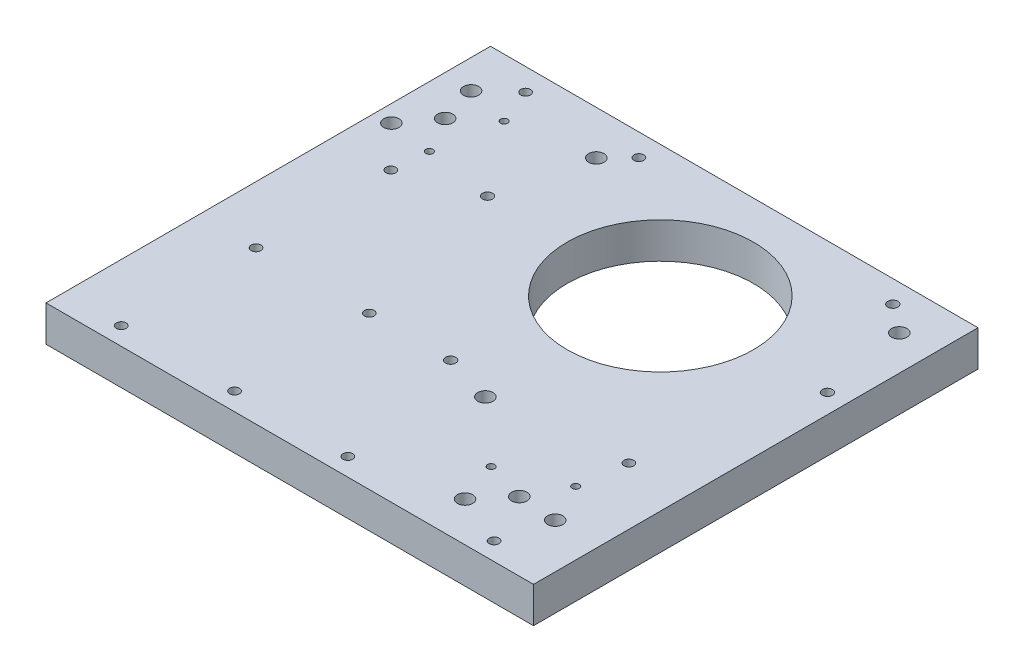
ISO-10303-21;
HEADER;
FILE_DESCRIPTION(('STEP AP214'),'2;1');
FILE_NAME('part.step','',(''),(''),'','','');
FILE_SCHEMA(('AUTOMOTIVE_DESIGN { 1 0 10303 214 1 1 1 1 }'));
ENDSEC;
DATA;
#1=APPLICATION_CONTEXT('core data for automotive mechanical design processes');
#2=APPLICATION_PROTOCOL_DEFINITION('international standard','automotive_design',2000,#1);
#3=PRODUCT_CONTEXT('',#1,'mechanical');
#4=PRODUCT('Part','Part','',(#3));
#5=PRODUCT_RELATED_PRODUCT_CATEGORY('part','',(#4));
#6=PRODUCT_DEFINITION_FORMATION('','',#4);
#7=PRODUCT_DEFINITION_CONTEXT('part definition',#1,'design');
#8=PRODUCT_DEFINITION('design','',#6,#7);
#9=PRODUCT_DEFINITION_SHAPE('','',#8);
#10=(LENGTH_UNIT() NAMED_UNIT(*) SI_UNIT(.MILLI.,.METRE.));
#11=(NAMED_UNIT(*) PLANE_ANGLE_UNIT() SI_UNIT($,.RADIAN.));
#12=(NAMED_UNIT(*) SI_UNIT($,.STERADIAN.) SOLID_ANGLE_UNIT());
#13=UNCERTAINTY_MEASURE_WITH_UNIT(LENGTH_MEASURE(1.E-05),#10,'distance_accuracy_value','');
#14=(GEOMETRIC_REPRESENTATION_CONTEXT(3) GLOBAL_UNCERTAINTY_ASSIGNED_CONTEXT((#13)) GLOBAL_UNIT_ASSIGNED_CONTEXT((#10,
#11,#12)) REPRESENTATION_CONTEXT('',''));
#15=CARTESIAN_POINT('',(0.,0.,0.));
#16=DIRECTION('',(0.,0.,1.));
#17=DIRECTION('',(1.,0.,0.));
#18=AXIS2_PLACEMENT_3D('',#15,#16,#17);
#19=CARTESIAN_POINT('',(0.,15.875,0.));
#20=DIRECTION('',(0.,1.,0.));
#21=DIRECTION('',(0.,0.,1.));
#22=AXIS2_PLACEMENT_3D('',#19,#20,#21);
#23=PLANE('',#22);
#24=CARTESIAN_POINT('',(-81.1540469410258,15.875,-44.5746197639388));
#25=DIRECTION('',(0.,-1.,0.));
#26=DIRECTION('',(0.,0.,-1.));
#27=AXIS2_PLACEMENT_3D('',#24,#25,#26);
#28=CIRCLE('',#27,1.5875);
#29=CARTESIAN_POINT('',(-81.1540469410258,15.875,-46.1621197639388));
#30=VERTEX_POINT('',#29);
#31=EDGE_CURVE('E341',#30,#30,#28,.T.);
#32=ORIENTED_EDGE('',*,*,#31,.T.);
#33=EDGE_LOOP('',(#32));
#34=FACE_BOUND('',#33,.T.);
#35=CARTESIAN_POINT('',(-76.192050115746,15.875,-72.7155012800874));
#36=DIRECTION('',(0.,-1.,0.));
#37=DIRECTION('',(0.,0.,-1.));
#38=AXIS2_PLACEMENT_3D('',#35,#36,#37);
#39=CIRCLE('',#38,1.5875);
#40=CARTESIAN_POINT('',(-76.192050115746,15.875,-74.3030012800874));
#41=VERTEX_POINT('',#40);
#42=EDGE_CURVE('E358',#41,#41,#39,.T.);
#43=ORIENTED_EDGE('',*,*,#42,.T.);
#44=EDGE_LOOP('',(#43));
#45=FACE_BOUND('',#44,.T.);
#46=CARTESIAN_POINT('',(-100.43925258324,15.875,-47.0079281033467));
#47=DIRECTION('',(0.,-1.,0.));
#48=DIRECTION('',(0.,0.,-1.));
#49=AXIS2_PLACEMENT_3D('',#46,#47,#48);
#50=CIRCLE('',#49,3.37819999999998);
#51=CARTESIAN_POINT('',(-100.43925258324,15.875,-50.3861281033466));
#52=VERTEX_POINT('',#51);
#53=EDGE_CURVE('E329',#52,#52,#50,.T.);
#54=ORIENTED_EDGE('',*,*,#53,.T.);
#55=EDGE_LOOP('',(#54));
#56=FACE_BOUND('',#55,.T.);
#57=CARTESIAN_POINT('',(-90.2886192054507,15.875,-60.6931990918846));
#58=DIRECTION('',(0.,-1.,0.));
#59=DIRECTION('',(0.,0.,-1.));
#60=AXIS2_PLACEMENT_3D('',#57,#58,#59);
#61=CIRCLE('',#60,3.37819999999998);
#62=CARTESIAN_POINT('',(-90.2886192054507,15.875,-64.0713990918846));
#63=VERTEX_POINT('',#62);
#64=EDGE_CURVE('E347',#63,#63,#61,.T.);
#65=ORIENTED_EDGE('',*,*,#64,.T.);
#66=EDGE_LOOP('',(#65));
#67=FACE_BOUND('',#66,.T.);
#68=CARTESIAN_POINT('',(-95.1464559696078,15.875,-77.0248683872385));
#69=DIRECTION('',(0.,-1.,0.));
#70=DIRECTION('',(0.,0.,-1.));
#71=AXIS2_PLACEMENT_3D('',#68,#69,#70);
#72=CIRCLE('',#71,3.37819999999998);
#73=CARTESIAN_POINT('',(-95.1464559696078,15.875,-80.4030683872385));
#74=VERTEX_POINT('',#73);
#75=EDGE_CURVE('E340',#74,#74,#72,.T.);
#76=ORIENTED_EDGE('',*,*,#75,.T.);
#77=EDGE_LOOP('',(#76));
#78=FACE_BOUND('',#77,.T.);
#79=CARTESIAN_POINT('',(79.7097942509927,15.875,51.4919157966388));
#80=DIRECTION('',(0.,-1.,0.));
#81=DIRECTION('',(0.,0.,-1.));
#82=AXIS2_PLACEMENT_3D('',#79,#80,#81);
#83=CIRCLE('',#82,1.5875);
#84=CARTESIAN_POINT('',(79.7097942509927,15.875,49.9044157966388));
#85=VERTEX_POINT('',#84);
#86=EDGE_CURVE('E311',#85,#85,#83,.T.);
#87=ORIENTED_EDGE('',*,*,#86,.T.);
#88=EDGE_LOOP('',(#87));
#89=FACE_BOUND('',#88,.T.);
#90=CARTESIAN_POINT('',(53.3900291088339,15.875,62.6184870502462));
#91=DIRECTION('',(0.,-1.,0.));
#92=DIRECTION('',(0.,0.,-1.));
#93=AXIS2_PLACEMENT_3D('',#90,#91,#92);
#94=CIRCLE('',#93,1.5875);
#95=CARTESIAN_POINT('',(53.3900291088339,15.875,61.0309870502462));
#96=VERTEX_POINT('',#95);
#97=EDGE_CURVE('E328',#96,#96,#94,.T.);
#98=ORIENTED_EDGE('',*,*,#97,.T.);
#99=EDGE_LOOP('',(#98));
#100=FACE_BOUND('',#99,.T.);
#101=CARTESIAN_POINT('',(88.1468644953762,15.875,69.0035117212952));
#102=DIRECTION('',(0.,-1.,0.));
#103=DIRECTION('',(0.,0.,-1.));
#104=AXIS2_PLACEMENT_3D('',#101,#102,#103);
#105=CIRCLE('',#104,3.37819999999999);
#106=CARTESIAN_POINT('',(88.1468644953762,15.875,65.6253117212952));
#107=VERTEX_POINT('',#106);
#108=EDGE_CURVE('E306',#107,#107,#105,.T.);
#109=ORIENTED_EDGE('',*,*,#108,.T.);
#110=EDGE_LOOP('',(#109));
#111=FACE_BOUND('',#110,.T.);
#112=CARTESIAN_POINT('',(71.1425707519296,15.875,67.9190790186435));
#113=DIRECTION('',(0.,-1.,0.));
#114=DIRECTION('',(0.,0.,-1.));
#115=AXIS2_PLACEMENT_3D('',#112,#113,#114);
#116=CIRCLE('',#115,3.37819999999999);
#117=CARTESIAN_POINT('',(71.1425707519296,15.875,64.5408790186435));
#118=VERTEX_POINT('',#117);
#119=EDGE_CURVE('E317',#118,#118,#116,.T.);
#120=ORIENTED_EDGE('',*,*,#119,.T.);
#121=EDGE_LOOP('',(#120));
#122=FACE_BOUND('',#121,.T.);
#123=CARTESIAN_POINT('',(60.0724483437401,15.875,80.8718543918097));
#124=DIRECTION('',(0.,-1.,0.));
#125=DIRECTION('',(0.,0.,-1.));
#126=AXIS2_PLACEMENT_3D('',#123,#124,#125);
#127=CIRCLE('',#126,3.3782);
#128=CARTESIAN_POINT('',(60.0724483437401,15.875,77.4936543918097));
#129=VERTEX_POINT('',#128);
#130=EDGE_CURVE('E310',#129,#129,#127,.T.);
#131=ORIENTED_EDGE('',*,*,#130,.T.);
#132=EDGE_LOOP('',(#131));
#133=FACE_BOUND('',#132,.T.);
#134=CARTESIAN_POINT('',(99.4010643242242,15.875,-40.2844));
#135=DIRECTION('',(0.,-1.,0.));
#136=DIRECTION('',(0.,0.,-1.));
#137=AXIS2_PLACEMENT_3D('',#134,#135,#136);
#138=CIRCLE('',#137,2.2479);
#139=CARTESIAN_POINT('',(99.4010643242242,15.875,-42.5323));
#140=VERTEX_POINT('',#139);
#141=EDGE_CURVE('E294',#140,#140,#138,.T.);
#142=ORIENTED_EDGE('',*,*,#141,.T.);
#143=EDGE_LOOP('',(#142));
#144=FACE_BOUND('',#143,.T.);
#145=CARTESIAN_POINT('',(3.62117958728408,15.875,30.7975000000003));
#146=DIRECTION('',(0.,-1.,0.));
#147=DIRECTION('',(0.,0.,-1.));
#148=AXIS2_PLACEMENT_3D('',#145,#146,#147);
#149=CIRCLE('',#148,2.2479);
#150=CARTESIAN_POINT('',(3.62117958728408,15.875,28.5496000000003));
#151=VERTEX_POINT('',#150);
#152=EDGE_CURVE('E282',#151,#151,#149,.T.);
#153=ORIENTED_EDGE('',*,*,#152,.T.);
#154=EDGE_LOOP('',(#153));
#155=FACE_BOUND('',#154,.T.);
#156=CARTESIAN_POINT('',(-51.1101831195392,15.875,-40.2844));
#157=DIRECTION('',(0.,-1.,0.));
#158=DIRECTION('',(0.,0.,-1.));
#159=AXIS2_PLACEMENT_3D('',#156,#157,#158);
#160=CIRCLE('',#159,2.2479);
#161=CARTESIAN_POINT('',(-51.1101831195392,15.875,-42.5323));
#162=VERTEX_POINT('',#161);
#163=EDGE_CURVE('E270',#162,#162,#160,.T.);
#164=ORIENTED_EDGE('',*,*,#163,.T.);
#165=EDGE_LOOP('',(#164));
#166=FACE_BOUND('',#165,.T.);
#167=CARTESIAN_POINT('',(80.0666155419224,15.875,-88.5824999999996));
#168=DIRECTION('',(0.,-1.,0.));
#169=DIRECTION('',(0.,0.,-1.));
#170=AXIS2_PLACEMENT_3D('',#167,#168,#169);
#171=CIRCLE('',#170,2.2479);
#172=CARTESIAN_POINT('',(80.0666155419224,15.875,-90.8303999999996));
#173=VERTEX_POINT('',#172);
#174=EDGE_CURVE('E258',#173,#173,#171,.T.);
#175=ORIENTED_EDGE('',*,*,#174,.T.);
#176=EDGE_LOOP('',(#175));
#177=FACE_BOUND('',#176,.T.);
#178=CARTESIAN_POINT('',(-82.55,15.875,90.4875));
#179=DIRECTION('',(0.,-1.,0.));
#180=DIRECTION('',(0.,0.,-1.));
#181=AXIS2_PLACEMENT_3D('',#178,#179,#180);
#182=CIRCLE('',#181,2.15264999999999);
#183=CARTESIAN_POINT('',(-82.55,15.875,88.33485));
#184=VERTEX_POINT('',#183);
#185=EDGE_CURVE('E246',#184,#184,#182,.T.);
#186=ORIENTED_EDGE('',*,*,#185,.T.);
#187=EDGE_LOOP('',(#186));
#188=FACE_BOUND('',#187,.T.);
#189=CARTESIAN_POINT('',(-32.385,15.875,90.4875000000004));
#190=DIRECTION('',(0.,-1.,0.));
#191=DIRECTION('',(0.,0.,-1.));
#192=AXIS2_PLACEMENT_3D('',#189,#190,#191);
#193=CIRCLE('',#192,2.15265);
#194=CARTESIAN_POINT('',(-32.385,15.875,88.3348500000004));
#195=VERTEX_POINT('',#194);
#196=EDGE_CURVE('E234',#195,#195,#193,.T.);
#197=ORIENTED_EDGE('',*,*,#196,.T.);
#198=EDGE_LOOP('',(#197));
#199=FACE_BOUND('',#198,.T.);
#200=CARTESIAN_POINT('',(25.4,15.875,-40.2844));
#201=DIRECTION('',(0.,1.,0.));
#202=DIRECTION('',(0.,0.,1.));
#203=AXIS2_PLACEMENT_3D('',#200,#201,#202);
#204=CIRCLE('',#203,41.275);
#205=CARTESIAN_POINT('',(25.4,15.875,0.990599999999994));
#206=VERTEX_POINT('',#205);
#207=EDGE_CURVE('E103',#206,#206,#204,.T.);
#208=ORIENTED_EDGE('',*,*,#207,.F.);
#209=EDGE_LOOP('',(#208));
#210=FACE_BOUND('',#209,.T.);
#211=DIRECTION('',(0.,0.,-1.));
#212=VECTOR('',#211,1.);
#213=CARTESIAN_POINT('',(107.95,15.875,-98.425));
#214=LINE('',#213,#212);
#215=CARTESIAN_POINT('',(107.95,15.875,98.425));
#216=VERTEX_POINT('',#215);
#217=CARTESIAN_POINT('',(107.95,15.875,-98.425));
#218=VERTEX_POINT('',#217);
#219=EDGE_CURVE('E88',#216,#218,#214,.T.);
#220=ORIENTED_EDGE('',*,*,#219,.T.);
#221=DIRECTION('',(-1.,0.,0.));
#222=VECTOR('',#221,1.);
#223=CARTESIAN_POINT('',(-107.95,15.875,-98.425));
#224=LINE('',#223,#222);
#225=CARTESIAN_POINT('',(-107.95,15.875,-98.425));
#226=VERTEX_POINT('',#225);
#227=EDGE_CURVE('E83',#218,#226,#224,.T.);
#228=ORIENTED_EDGE('',*,*,#227,.T.);
#229=DIRECTION('',(0.,0.,1.));
#230=VECTOR('',#229,1.);
#231=CARTESIAN_POINT('',(-107.95,15.875,-98.425));
#232=LINE('',#231,#230);
#233=CARTESIAN_POINT('',(-107.95,15.875,98.425));
#234=VERTEX_POINT('',#233);
#235=EDGE_CURVE('E86',#226,#234,#232,.T.);
#236=ORIENTED_EDGE('',*,*,#235,.T.);
#237=DIRECTION('',(1.,0.,0.));
#238=VECTOR('',#237,1.);
#239=CARTESIAN_POINT('',(-107.95,15.875,98.425));
#240=LINE('',#239,#238);
#241=EDGE_CURVE('E53',#234,#216,#240,.T.);
#242=ORIENTED_EDGE('',*,*,#241,.T.);
#243=EDGE_LOOP('',(#220,#228,#236,#242));
#244=FACE_BOUND('',#243,.T.);
#245=CARTESIAN_POINT('',(92.4909880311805,15.875,-79.0194));
#246=DIRECTION('',(0.,1.,0.));
#247=DIRECTION('',(0.,0.,1.));
#248=AXIS2_PLACEMENT_3D('',#245,#246,#247);
#249=CIRCLE('',#248,3.37819999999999);
#250=CARTESIAN_POINT('',(92.4909880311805,15.875,-75.6412));
#251=VERTEX_POINT('',#250);
#252=EDGE_CURVE('E121',#251,#251,#249,.T.);
#253=ORIENTED_EDGE('',*,*,#252,.F.);
#254=EDGE_LOOP('',(#253));
#255=FACE_BOUND('',#254,.T.);
#256=CARTESIAN_POINT('',(-41.6909880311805,15.875,-79.0193999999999));
#257=DIRECTION('',(0.,1.,0.));
#258=DIRECTION('',(0.,0.,1.));
#259=AXIS2_PLACEMENT_3D('',#256,#257,#258);
#260=CIRCLE('',#259,3.37819999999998);
#261=CARTESIAN_POINT('',(-41.6909880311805,15.875,-75.6412));
#262=VERTEX_POINT('',#261);
#263=EDGE_CURVE('E128',#262,#262,#260,.T.);
#264=ORIENTED_EDGE('',*,*,#263,.F.);
#265=EDGE_LOOP('',(#264));
#266=FACE_BOUND('',#265,.T.);
#267=CARTESIAN_POINT('',(25.4,15.875,37.1856));
#268=DIRECTION('',(0.,1.,0.));
#269=DIRECTION('',(0.,0.,1.));
#270=AXIS2_PLACEMENT_3D('',#267,#268,#269);
#271=CIRCLE('',#270,3.3782);
#272=CARTESIAN_POINT('',(25.4,15.875,40.5638));
#273=VERTEX_POINT('',#272);
#274=EDGE_CURVE('E134',#273,#273,#271,.T.);
#275=ORIENTED_EDGE('',*,*,#274,.F.);
#276=EDGE_LOOP('',(#275));
#277=FACE_BOUND('',#276,.T.);
#278=CARTESIAN_POINT('',(82.5499999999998,15.875,30.7975));
#279=DIRECTION('',(0.,-1.,0.));
#280=DIRECTION('',(0.,0.,-1.));
#281=AXIS2_PLACEMENT_3D('',#278,#279,#280);
#282=CIRCLE('',#281,2.15264999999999);
#283=CARTESIAN_POINT('',(82.5499999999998,15.875,28.64485));
#284=VERTEX_POINT('',#283);
#285=EDGE_CURVE('E125',#284,#284,#282,.T.);
#286=ORIENTED_EDGE('',*,*,#285,.T.);
#287=EDGE_LOOP('',(#286));
#288=FACE_BOUND('',#287,.T.);
#289=CARTESIAN_POINT('',(82.55,15.875,90.4875));
#290=DIRECTION('',(0.,-1.,0.));
#291=DIRECTION('',(0.,0.,-1.));
#292=AXIS2_PLACEMENT_3D('',#289,#290,#291);
#293=CIRCLE('',#292,2.15264999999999);
#294=CARTESIAN_POINT('',(82.55,15.875,88.33485));
#295=VERTEX_POINT('',#294);
#296=EDGE_CURVE('E150',#295,#295,#293,.T.);
#297=ORIENTED_EDGE('',*,*,#296,.T.);
#298=EDGE_LOOP('',(#297));
#299=FACE_BOUND('',#298,.T.);
#300=CARTESIAN_POINT('',(17.78,15.875,90.4875));
#301=DIRECTION('',(0.,-1.,0.));
#302=DIRECTION('',(0.,0.,-1.));
#303=AXIS2_PLACEMENT_3D('',#300,#301,#302);
#304=CIRCLE('',#303,2.15265);
#305=CARTESIAN_POINT('',(17.78,15.875,88.33485));
#306=VERTEX_POINT('',#305);
#307=EDGE_CURVE('E162',#306,#306,#304,.T.);
#308=ORIENTED_EDGE('',*,*,#307,.T.);
#309=EDGE_LOOP('',(#308));
#310=FACE_BOUND('',#309,.T.);
#311=CARTESIAN_POINT('',(-32.3850000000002,15.875,30.7975000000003));
#312=DIRECTION('',(0.,-1.,0.));
#313=DIRECTION('',(0.,0.,-1.));
#314=AXIS2_PLACEMENT_3D('',#311,#312,#313);
#315=CIRCLE('',#314,2.15265);
#316=CARTESIAN_POINT('',(-32.3850000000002,15.875,28.6448500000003));
#317=VERTEX_POINT('',#316);
#318=EDGE_CURVE('E174',#317,#317,#315,.T.);
#319=ORIENTED_EDGE('',*,*,#318,.T.);
#320=EDGE_LOOP('',(#319));
#321=FACE_BOUND('',#320,.T.);
#322=CARTESIAN_POINT('',(-32.3850000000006,15.875,-88.5824999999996));
#323=DIRECTION('',(0.,-1.,0.));
#324=DIRECTION('',(0.,0.,-1.));
#325=AXIS2_PLACEMENT_3D('',#322,#323,#324);
#326=CIRCLE('',#325,2.15265);
#327=CARTESIAN_POINT('',(-32.3850000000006,15.875,-90.7351499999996));
#328=VERTEX_POINT('',#327);
#329=EDGE_CURVE('E186',#328,#328,#326,.T.);
#330=ORIENTED_EDGE('',*,*,#329,.T.);
#331=EDGE_LOOP('',(#330));
#332=FACE_BOUND('',#331,.T.);
#333=CARTESIAN_POINT('',(-82.5500000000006,15.875,-88.5824999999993));
#334=DIRECTION('',(0.,-1.,0.));
#335=DIRECTION('',(0.,0.,-1.));
#336=AXIS2_PLACEMENT_3D('',#333,#334,#335);
#337=CIRCLE('',#336,2.15264999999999);
#338=CARTESIAN_POINT('',(-82.5500000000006,15.875,-90.7351499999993));
#339=VERTEX_POINT('',#338);
#340=EDGE_CURVE('E198',#339,#339,#337,.T.);
#341=ORIENTED_EDGE('',*,*,#340,.T.);
#342=EDGE_LOOP('',(#341));
#343=FACE_BOUND('',#342,.T.);
#344=CARTESIAN_POINT('',(-82.5500000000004,15.875,-28.8924999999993));
#345=DIRECTION('',(0.,-1.,0.));
#346=DIRECTION('',(0.,0.,-1.));
#347=AXIS2_PLACEMENT_3D('',#344,#345,#346);
#348=CIRCLE('',#347,2.15264999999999);
#349=CARTESIAN_POINT('',(-82.5500000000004,15.875,-31.0451499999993));
#350=VERTEX_POINT('',#349);
#351=EDGE_CURVE('E210',#350,#350,#348,.T.);
#352=ORIENTED_EDGE('',*,*,#351,.T.);
#353=EDGE_LOOP('',(#352));
#354=FACE_BOUND('',#353,.T.);
#355=CARTESIAN_POINT('',(-82.5500000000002,15.875,30.7975000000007));
#356=DIRECTION('',(0.,-1.,0.));
#357=DIRECTION('',(0.,0.,-1.));
#358=AXIS2_PLACEMENT_3D('',#355,#356,#357);
#359=CIRCLE('',#358,2.15264999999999);
#360=CARTESIAN_POINT('',(-82.5500000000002,15.875,28.6448500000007));
#361=VERTEX_POINT('',#360);
#362=EDGE_CURVE('E222',#361,#361,#359,.T.);
#363=ORIENTED_EDGE('',*,*,#362,.T.);
#364=EDGE_LOOP('',(#363));
#365=FACE_BOUND('',#364,.T.);
#366=ADVANCED_FACE('F36',(#34,#45,#56,#67,#78,#89,#100,#111,#122,#133,#144,#155,#166,#177,#188,
#199,#210,#244,#255,#266,#277,#288,#299,#310,#321,#332,#343,#354,#365),#23,.T.);
#367=CARTESIAN_POINT('',(0.,0.,0.));
#368=DIRECTION('',(0.,1.,0.));
#369=DIRECTION('',(0.,0.,1.));
#370=AXIS2_PLACEMENT_3D('',#367,#368,#369);
#371=PLANE('',#370);
#372=CARTESIAN_POINT('',(-81.1540469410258,0.,-44.5746197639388));
#373=DIRECTION('',(0.,-1.,0.));
#374=DIRECTION('',(0.,0.,-1.));
#375=AXIS2_PLACEMENT_3D('',#372,#373,#374);
#376=CIRCLE('',#375,1.5875);
#377=CARTESIAN_POINT('',(-81.1540469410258,0.,-46.1621197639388));
#378=VERTEX_POINT('',#377);
#379=EDGE_CURVE('E362',#378,#378,#376,.T.);
#380=ORIENTED_EDGE('',*,*,#379,.F.);
#381=EDGE_LOOP('',(#380));
#382=FACE_BOUND('',#381,.T.);
#383=CARTESIAN_POINT('',(-76.192050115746,0.,-72.7155012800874));
#384=DIRECTION('',(0.,-1.,0.));
#385=DIRECTION('',(0.,0.,-1.));
#386=AXIS2_PLACEMENT_3D('',#383,#384,#385);
#387=CIRCLE('',#386,1.5875);
#388=CARTESIAN_POINT('',(-76.192050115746,0.,-74.3030012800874));
#389=VERTEX_POINT('',#388);
#390=EDGE_CURVE('E355',#389,#389,#387,.T.);
#391=ORIENTED_EDGE('',*,*,#390,.F.);
#392=EDGE_LOOP('',(#391));
#393=FACE_BOUND('',#392,.T.);
#394=CARTESIAN_POINT('',(-100.43925258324,0.,-47.0079281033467));
#395=DIRECTION('',(0.,-1.,0.));
#396=DIRECTION('',(0.,0.,-1.));
#397=AXIS2_PLACEMENT_3D('',#394,#395,#396);
#398=CIRCLE('',#397,3.37819999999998);
#399=CARTESIAN_POINT('',(-100.43925258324,0.,-50.3861281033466));
#400=VERTEX_POINT('',#399);
#401=EDGE_CURVE('E350',#400,#400,#398,.T.);
#402=ORIENTED_EDGE('',*,*,#401,.F.);
#403=EDGE_LOOP('',(#402));
#404=FACE_BOUND('',#403,.T.);
#405=CARTESIAN_POINT('',(-90.2886192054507,0.,-60.6931990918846));
#406=DIRECTION('',(0.,-1.,0.));
#407=DIRECTION('',(0.,0.,-1.));
#408=AXIS2_PLACEMENT_3D('',#405,#406,#407);
#409=CIRCLE('',#408,3.37819999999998);
#410=CARTESIAN_POINT('',(-90.2886192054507,0.,-64.0713990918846));
#411=VERTEX_POINT('',#410);
#412=EDGE_CURVE('E344',#411,#411,#409,.T.);
#413=ORIENTED_EDGE('',*,*,#412,.F.);
#414=EDGE_LOOP('',(#413));
#415=FACE_BOUND('',#414,.T.);
#416=CARTESIAN_POINT('',(-95.1464559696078,0.,-77.0248683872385));
#417=DIRECTION('',(0.,-1.,0.));
#418=DIRECTION('',(0.,0.,-1.));
#419=AXIS2_PLACEMENT_3D('',#416,#417,#418);
#420=CIRCLE('',#419,3.37819999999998);
#421=CARTESIAN_POINT('',(-95.1464559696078,0.,-80.4030683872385));
#422=VERTEX_POINT('',#421);
#423=EDGE_CURVE('E337',#422,#422,#420,.T.);
#424=ORIENTED_EDGE('',*,*,#423,.F.);
#425=EDGE_LOOP('',(#424));
#426=FACE_BOUND('',#425,.T.);
#427=CARTESIAN_POINT('',(79.7097942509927,0.,51.4919157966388));
#428=DIRECTION('',(0.,-1.,0.));
#429=DIRECTION('',(0.,0.,-1.));
#430=AXIS2_PLACEMENT_3D('',#427,#428,#429);
#431=CIRCLE('',#430,1.5875);
#432=CARTESIAN_POINT('',(79.7097942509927,0.,49.9044157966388));
#433=VERTEX_POINT('',#432);
#434=EDGE_CURVE('E332',#433,#433,#431,.T.);
#435=ORIENTED_EDGE('',*,*,#434,.F.);
#436=EDGE_LOOP('',(#435));
#437=FACE_BOUND('',#436,.T.);
#438=CARTESIAN_POINT('',(53.3900291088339,0.,62.6184870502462));
#439=DIRECTION('',(0.,-1.,0.));
#440=DIRECTION('',(0.,0.,-1.));
#441=AXIS2_PLACEMENT_3D('',#438,#439,#440);
#442=CIRCLE('',#441,1.5875);
#443=CARTESIAN_POINT('',(53.3900291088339,0.,61.0309870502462));
#444=VERTEX_POINT('',#443);
#445=EDGE_CURVE('E325',#444,#444,#442,.T.);
#446=ORIENTED_EDGE('',*,*,#445,.F.);
#447=EDGE_LOOP('',(#446));
#448=FACE_BOUND('',#447,.T.);
#449=CARTESIAN_POINT('',(88.1468644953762,0.,69.0035117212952));
#450=DIRECTION('',(0.,-1.,0.));
#451=DIRECTION('',(0.,0.,-1.));
#452=AXIS2_PLACEMENT_3D('',#449,#450,#451);
#453=CIRCLE('',#452,3.37819999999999);
#454=CARTESIAN_POINT('',(88.1468644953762,0.,65.6253117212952));
#455=VERTEX_POINT('',#454);
#456=EDGE_CURVE('E320',#455,#455,#453,.T.);
#457=ORIENTED_EDGE('',*,*,#456,.F.);
#458=EDGE_LOOP('',(#457));
#459=FACE_BOUND('',#458,.T.);
#460=CARTESIAN_POINT('',(71.1425707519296,0.,67.9190790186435));
#461=DIRECTION('',(0.,-1.,0.));
#462=DIRECTION('',(0.,0.,-1.));
#463=AXIS2_PLACEMENT_3D('',#460,#461,#462);
#464=CIRCLE('',#463,3.37819999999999);
#465=CARTESIAN_POINT('',(71.1425707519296,0.,64.5408790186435));
#466=VERTEX_POINT('',#465);
#467=EDGE_CURVE('E314',#466,#466,#464,.T.);
#468=ORIENTED_EDGE('',*,*,#467,.F.);
#469=EDGE_LOOP('',(#468));
#470=FACE_BOUND('',#469,.T.);
#471=CARTESIAN_POINT('',(60.0724483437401,0.,80.8718543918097));
#472=DIRECTION('',(0.,-1.,0.));
#473=DIRECTION('',(0.,0.,-1.));
#474=AXIS2_PLACEMENT_3D('',#471,#472,#473);
#475=CIRCLE('',#474,3.3782);
#476=CARTESIAN_POINT('',(60.0724483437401,0.,77.4936543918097));
#477=VERTEX_POINT('',#476);
#478=EDGE_CURVE('E307',#477,#477,#475,.T.);
#479=ORIENTED_EDGE('',*,*,#478,.F.);
#480=EDGE_LOOP('',(#479));
#481=FACE_BOUND('',#480,.T.);
#482=CARTESIAN_POINT('',(99.4010643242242,0.,-40.2844));
#483=DIRECTION('',(0.,-1.,0.));
#484=DIRECTION('',(0.,0.,-1.));
#485=AXIS2_PLACEMENT_3D('',#482,#483,#484);
#486=CIRCLE('',#485,3.96874999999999);
#487=CARTESIAN_POINT('',(99.4010643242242,0.,-44.25315));
#488=VERTEX_POINT('',#487);
#489=EDGE_CURVE('E303',#488,#488,#486,.T.);
#490=ORIENTED_EDGE('',*,*,#489,.F.);
#491=EDGE_LOOP('',(#490));
#492=FACE_BOUND('',#491,.T.);
#493=CARTESIAN_POINT('',(3.62117958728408,0.,30.7975000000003));
#494=DIRECTION('',(0.,-1.,0.));
#495=DIRECTION('',(0.,0.,-1.));
#496=AXIS2_PLACEMENT_3D('',#493,#494,#495);
#497=CIRCLE('',#496,3.96875);
#498=CARTESIAN_POINT('',(3.62117958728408,0.,26.8287500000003));
#499=VERTEX_POINT('',#498);
#500=EDGE_CURVE('E291',#499,#499,#497,.T.);
#501=ORIENTED_EDGE('',*,*,#500,.F.);
#502=EDGE_LOOP('',(#501));
#503=FACE_BOUND('',#502,.T.);
#504=CARTESIAN_POINT('',(-51.1101831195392,0.,-40.2844));
#505=DIRECTION('',(0.,-1.,0.));
#506=DIRECTION('',(0.,0.,-1.));
#507=AXIS2_PLACEMENT_3D('',#504,#505,#506);
#508=CIRCLE('',#507,3.96875);
#509=CARTESIAN_POINT('',(-51.1101831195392,0.,-44.25315));
#510=VERTEX_POINT('',#509);
#511=EDGE_CURVE('E279',#510,#510,#508,.T.);
#512=ORIENTED_EDGE('',*,*,#511,.F.);
#513=EDGE_LOOP('',(#512));
#514=FACE_BOUND('',#513,.T.);
#515=CARTESIAN_POINT('',(80.0666155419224,0.,-88.5824999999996));
#516=DIRECTION('',(0.,-1.,0.));
#517=DIRECTION('',(0.,0.,-1.));
#518=AXIS2_PLACEMENT_3D('',#515,#516,#517);
#519=CIRCLE('',#518,3.96874999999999);
#520=CARTESIAN_POINT('',(80.0666155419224,0.,-92.5512499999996));
#521=VERTEX_POINT('',#520);
#522=EDGE_CURVE('E267',#521,#521,#519,.T.);
#523=ORIENTED_EDGE('',*,*,#522,.F.);
#524=EDGE_LOOP('',(#523));
#525=FACE_BOUND('',#524,.T.);
#526=CARTESIAN_POINT('',(-82.55,0.,90.4875));
#527=DIRECTION('',(0.,-1.,0.));
#528=DIRECTION('',(0.,0.,-1.));
#529=AXIS2_PLACEMENT_3D('',#526,#527,#528);
#530=CIRCLE('',#529,3.96874999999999);
#531=CARTESIAN_POINT('',(-82.55,0.,86.51875));
#532=VERTEX_POINT('',#531);
#533=EDGE_CURVE('E255',#532,#532,#530,.T.);
#534=ORIENTED_EDGE('',*,*,#533,.F.);
#535=EDGE_LOOP('',(#534));
#536=FACE_BOUND('',#535,.T.);
#537=CARTESIAN_POINT('',(-32.385,0.,90.4875000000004));
#538=DIRECTION('',(0.,-1.,0.));
#539=DIRECTION('',(0.,0.,-1.));
#540=AXIS2_PLACEMENT_3D('',#537,#538,#539);
#541=CIRCLE('',#540,3.96875);
#542=CARTESIAN_POINT('',(-32.385,0.,86.5187500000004));
#543=VERTEX_POINT('',#542);
#544=EDGE_CURVE('E243',#543,#543,#541,.T.);
#545=ORIENTED_EDGE('',*,*,#544,.F.);
#546=EDGE_LOOP('',(#545));
#547=FACE_BOUND('',#546,.T.);
#548=CARTESIAN_POINT('',(-82.5500000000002,0.,30.7975000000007));
#549=DIRECTION('',(0.,-1.,0.));
#550=DIRECTION('',(0.,0.,-1.));
#551=AXIS2_PLACEMENT_3D('',#548,#549,#550);
#552=CIRCLE('',#551,3.96874999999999);
#553=CARTESIAN_POINT('',(-82.5500000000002,0.,26.8287500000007));
#554=VERTEX_POINT('',#553);
#555=EDGE_CURVE('E231',#554,#554,#552,.T.);
#556=ORIENTED_EDGE('',*,*,#555,.F.);
#557=EDGE_LOOP('',(#556));
#558=FACE_BOUND('',#557,.T.);
#559=CARTESIAN_POINT('',(-82.5500000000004,0.,-28.8924999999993));
#560=DIRECTION('',(0.,-1.,0.));
#561=DIRECTION('',(0.,0.,-1.));
#562=AXIS2_PLACEMENT_3D('',#559,#560,#561);
#563=CIRCLE('',#562,3.96874999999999);
#564=CARTESIAN_POINT('',(-82.5500000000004,0.,-32.8612499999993));
#565=VERTEX_POINT('',#564);
#566=EDGE_CURVE('E219',#565,#565,#563,.T.);
#567=ORIENTED_EDGE('',*,*,#566,.F.);
#568=EDGE_LOOP('',(#567));
#569=FACE_BOUND('',#568,.T.);
#570=CARTESIAN_POINT('',(-82.5500000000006,0.,-88.5824999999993));
#571=DIRECTION('',(0.,-1.,0.));
#572=DIRECTION('',(0.,0.,-1.));
#573=AXIS2_PLACEMENT_3D('',#570,#571,#572);
#574=CIRCLE('',#573,3.96874999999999);
#575=CARTESIAN_POINT('',(-82.5500000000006,0.,-92.5512499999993));
#576=VERTEX_POINT('',#575);
#577=EDGE_CURVE('E207',#576,#576,#574,.T.);
#578=ORIENTED_EDGE('',*,*,#577,.F.);
#579=EDGE_LOOP('',(#578));
#580=FACE_BOUND('',#579,.T.);
#581=CARTESIAN_POINT('',(-32.3850000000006,0.,-88.5824999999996));
#582=DIRECTION('',(0.,-1.,0.));
#583=DIRECTION('',(0.,0.,-1.));
#584=AXIS2_PLACEMENT_3D('',#581,#582,#583);
#585=CIRCLE('',#584,3.96875);
#586=CARTESIAN_POINT('',(-32.3850000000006,0.,-92.5512499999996));
#587=VERTEX_POINT('',#586);
#588=EDGE_CURVE('E195',#587,#587,#585,.T.);
#589=ORIENTED_EDGE('',*,*,#588,.F.);
#590=EDGE_LOOP('',(#589));
#591=FACE_BOUND('',#590,.T.);
#592=CARTESIAN_POINT('',(-32.3850000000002,0.,30.7975000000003));
#593=DIRECTION('',(0.,-1.,0.));
#594=DIRECTION('',(0.,0.,-1.));
#595=AXIS2_PLACEMENT_3D('',#592,#593,#594);
#596=CIRCLE('',#595,3.96875);
#597=CARTESIAN_POINT('',(-32.3850000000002,0.,26.8287500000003));
#598=VERTEX_POINT('',#597);
#599=EDGE_CURVE('E183',#598,#598,#596,.T.);
#600=ORIENTED_EDGE('',*,*,#599,.F.);
#601=EDGE_LOOP('',(#600));
#602=FACE_BOUND('',#601,.T.);
#603=CARTESIAN_POINT('',(17.78,0.,90.4875));
#604=DIRECTION('',(0.,-1.,0.));
#605=DIRECTION('',(0.,0.,-1.));
#606=AXIS2_PLACEMENT_3D('',#603,#604,#605);
#607=CIRCLE('',#606,3.96875);
#608=CARTESIAN_POINT('',(17.78,0.,86.51875));
#609=VERTEX_POINT('',#608);
#610=EDGE_CURVE('E171',#609,#609,#607,.T.);
#611=ORIENTED_EDGE('',*,*,#610,.F.);
#612=EDGE_LOOP('',(#611));
#613=FACE_BOUND('',#612,.T.);
#614=CARTESIAN_POINT('',(82.55,0.,90.4875));
#615=DIRECTION('',(0.,-1.,0.));
#616=DIRECTION('',(0.,0.,-1.));
#617=AXIS2_PLACEMENT_3D('',#614,#615,#616);
#618=CIRCLE('',#617,3.96874999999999);
#619=CARTESIAN_POINT('',(82.55,0.,86.51875));
#620=VERTEX_POINT('',#619);
#621=EDGE_CURVE('E159',#620,#620,#618,.T.);
#622=ORIENTED_EDGE('',*,*,#621,.F.);
#623=EDGE_LOOP('',(#622));
#624=FACE_BOUND('',#623,.T.);
#625=CARTESIAN_POINT('',(82.5499999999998,0.,30.7975));
#626=DIRECTION('',(0.,-1.,0.));
#627=DIRECTION('',(0.,0.,-1.));
#628=AXIS2_PLACEMENT_3D('',#625,#626,#627);
#629=CIRCLE('',#628,3.96874999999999);
#630=CARTESIAN_POINT('',(82.5499999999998,0.,26.82875));
#631=VERTEX_POINT('',#630);
#632=EDGE_CURVE('E147',#631,#631,#629,.T.);
#633=ORIENTED_EDGE('',*,*,#632,.F.);
#634=EDGE_LOOP('',(#633));
#635=FACE_BOUND('',#634,.T.);
#636=CARTESIAN_POINT('',(25.4,0.,37.1856));
#637=DIRECTION('',(0.,1.,0.));
#638=DIRECTION('',(0.,0.,1.));
#639=AXIS2_PLACEMENT_3D('',#636,#637,#638);
#640=CIRCLE('',#639,3.3782);
#641=CARTESIAN_POINT('',(25.4,0.,40.5638));
#642=VERTEX_POINT('',#641);
#643=EDGE_CURVE('E118',#642,#642,#640,.T.);
#644=ORIENTED_EDGE('',*,*,#643,.T.);
#645=EDGE_LOOP('',(#644));
#646=FACE_BOUND('',#645,.T.);
#647=CARTESIAN_POINT('',(-41.6909880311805,0.,-79.0193999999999));
#648=DIRECTION('',(0.,1.,0.));
#649=DIRECTION('',(0.,0.,1.));
#650=AXIS2_PLACEMENT_3D('',#647,#648,#649);
#651=CIRCLE('',#650,3.37819999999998);
#652=CARTESIAN_POINT('',(-41.6909880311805,0.,-75.6412));
#653=VERTEX_POINT('',#652);
#654=EDGE_CURVE('E131',#653,#653,#651,.T.);
#655=ORIENTED_EDGE('',*,*,#654,.T.);
#656=EDGE_LOOP('',(#655));
#657=FACE_BOUND('',#656,.T.);
#658=CARTESIAN_POINT('',(92.4909880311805,0.,-79.0194));
#659=DIRECTION('',(0.,1.,0.));
#660=DIRECTION('',(0.,0.,1.));
#661=AXIS2_PLACEMENT_3D('',#658,#659,#660);
#662=CIRCLE('',#661,3.37819999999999);
#663=CARTESIAN_POINT('',(92.4909880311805,0.,-75.6412));
#664=VERTEX_POINT('',#663);
#665=EDGE_CURVE('E124',#664,#664,#662,.T.);
#666=ORIENTED_EDGE('',*,*,#665,.T.);
#667=EDGE_LOOP('',(#666));
#668=FACE_BOUND('',#667,.T.);
#669=DIRECTION('',(0.,0.,-1.));
#670=VECTOR('',#669,1.);
#671=CARTESIAN_POINT('',(107.95,0.,-98.425));
#672=LINE('',#671,#670);
#673=CARTESIAN_POINT('',(107.95,0.,98.425));
#674=VERTEX_POINT('',#673);
#675=CARTESIAN_POINT('',(107.95,0.,-98.425));
#676=VERTEX_POINT('',#675);
#677=EDGE_CURVE('E100',#674,#676,#672,.T.);
#678=ORIENTED_EDGE('',*,*,#677,.F.);
#679=DIRECTION('',(1.,0.,0.));
#680=VECTOR('',#679,1.);
#681=CARTESIAN_POINT('',(-107.95,0.,98.425));
#682=LINE('',#681,#680);
#683=CARTESIAN_POINT('',(-107.95,0.,98.425));
#684=VERTEX_POINT('',#683);
#685=EDGE_CURVE('E76',#684,#674,#682,.T.);
#686=ORIENTED_EDGE('',*,*,#685,.F.);
#687=DIRECTION('',(0.,0.,1.));
#688=VECTOR('',#687,1.);
#689=CARTESIAN_POINT('',(-107.95,0.,-98.425));
#690=LINE('',#689,#688);
#691=CARTESIAN_POINT('',(-107.95,0.,-98.425));
#692=VERTEX_POINT('',#691);
#693=EDGE_CURVE('E70',#692,#684,#690,.T.);
#694=ORIENTED_EDGE('',*,*,#693,.F.);
#695=DIRECTION('',(-1.,0.,0.));
#696=VECTOR('',#695,1.);
#697=CARTESIAN_POINT('',(-107.95,0.,-98.425));
#698=LINE('',#697,#696);
#699=EDGE_CURVE('E92',#676,#692,#698,.T.);
#700=ORIENTED_EDGE('',*,*,#699,.F.);
#701=EDGE_LOOP('',(#678,#686,#694,#700));
#702=FACE_BOUND('',#701,.T.);
#703=CARTESIAN_POINT('',(25.4,0.,-40.2844));
#704=DIRECTION('',(0.,1.,0.));
#705=DIRECTION('',(0.,0.,1.));
#706=AXIS2_PLACEMENT_3D('',#703,#704,#705);
#707=CIRCLE('',#706,41.275);
#708=CARTESIAN_POINT('',(25.4,0.,0.990599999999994));
#709=VERTEX_POINT('',#708);
#710=EDGE_CURVE('E115',#709,#709,#707,.T.);
#711=ORIENTED_EDGE('',*,*,#710,.T.);
#712=EDGE_LOOP('',(#711));
#713=FACE_BOUND('',#712,.T.);
#714=ADVANCED_FACE('F111',(#382,#393,#404,#415,#426,#437,#448,#459,#470,#481,#492,#503,#514,
#525,#536,#547,#558,#569,#580,#591,#602,#613,#624,#635,#646,#657,#668,#702,#713),#371,.F.);
#715=CARTESIAN_POINT('',(107.95,15.875,-98.425));
#716=DIRECTION('',(-1.,0.,0.));
#717=DIRECTION('',(0.,0.,1.));
#718=AXIS2_PLACEMENT_3D('',#715,#716,#717);
#719=PLANE('',#718);
#720=ORIENTED_EDGE('',*,*,#677,.T.);
#721=DIRECTION('',(0.,-1.,0.));
#722=VECTOR('',#721,1.);
#723=CARTESIAN_POINT('',(107.95,15.875,-98.425));
#724=LINE('',#723,#722);
#725=EDGE_CURVE('E11',#218,#676,#724,.T.);
#726=ORIENTED_EDGE('',*,*,#725,.F.);
#727=ORIENTED_EDGE('',*,*,#219,.F.);
#728=DIRECTION('',(0.,-1.,0.));
#729=VECTOR('',#728,1.);
#730=CARTESIAN_POINT('',(107.95,15.875,98.425));
#731=LINE('',#730,#729);
#732=EDGE_CURVE('E96',#216,#674,#731,.T.);
#733=ORIENTED_EDGE('',*,*,#732,.T.);
#734=EDGE_LOOP('',(#720,#726,#727,#733));
#735=FACE_BOUND('',#734,.T.);
#736=ADVANCED_FACE('F38',(#735),#719,.F.);
#737=CARTESIAN_POINT('',(-107.95,15.875,-98.425));
#738=DIRECTION('',(0.,0.,1.));
#739=DIRECTION('',(1.,0.,0.));
#740=AXIS2_PLACEMENT_3D('',#737,#738,#739);
#741=PLANE('',#740);
#742=CARTESIAN_POINT('',(43.2614400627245,7.93749999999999,-98.425));
#743=DIRECTION('',(0.,0.,-1.));
#744=DIRECTION('',(-1.,0.,0.));
#745=AXIS2_PLACEMENT_3D('',#742,#743,#744);
#746=CIRCLE('',#745,1.5875);
#747=CARTESIAN_POINT('',(41.6739400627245,7.93749999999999,-98.425));
#748=VERTEX_POINT('',#747);
#749=EDGE_CURVE('E385',#748,#748,#746,.T.);
#750=ORIENTED_EDGE('',*,*,#749,.F.);
#751=EDGE_LOOP('',(#750));
#752=FACE_BOUND('',#751,.T.);
#753=CARTESIAN_POINT('',(11.5114400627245,7.93749999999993,-98.425));
#754=DIRECTION('',(0.,0.,-1.));
#755=DIRECTION('',(-1.,0.,0.));
#756=AXIS2_PLACEMENT_3D('',#753,#754,#755);
#757=CIRCLE('',#756,1.5875);
#758=CARTESIAN_POINT('',(9.92394006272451,7.93749999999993,-98.425));
#759=VERTEX_POINT('',#758);
#760=EDGE_CURVE('E379',#759,#759,#757,.T.);
#761=ORIENTED_EDGE('',*,*,#760,.F.);
#762=EDGE_LOOP('',(#761));
#763=FACE_BOUND('',#762,.T.);
#764=CARTESIAN_POINT('',(57.5489400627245,7.93749999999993,-98.425));
#765=DIRECTION('',(0.,0.,-1.));
#766=DIRECTION('',(-1.,0.,0.));
#767=AXIS2_PLACEMENT_3D('',#764,#765,#766);
#768=CIRCLE('',#767,3.37819999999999);
#769=CARTESIAN_POINT('',(54.1707400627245,7.93749999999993,-98.425));
#770=VERTEX_POINT('',#769);
#771=EDGE_CURVE('E374',#770,#770,#768,.T.);
#772=ORIENTED_EDGE('',*,*,#771,.F.);
#773=EDGE_LOOP('',(#772));
#774=FACE_BOUND('',#773,.T.);
#775=CARTESIAN_POINT('',(-2.7760599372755,7.93749999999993,-98.425));
#776=DIRECTION('',(0.,0.,-1.));
#777=DIRECTION('',(-1.,0.,0.));
#778=AXIS2_PLACEMENT_3D('',#775,#776,#777);
#779=CIRCLE('',#778,3.37819999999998);
#780=CARTESIAN_POINT('',(-6.15425993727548,7.93749999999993,-98.425));
#781=VERTEX_POINT('',#780);
#782=EDGE_CURVE('E367',#781,#781,#779,.T.);
#783=ORIENTED_EDGE('',*,*,#782,.F.);
#784=EDGE_LOOP('',(#783));
#785=FACE_BOUND('',#784,.T.);
#786=ORIENTED_EDGE('',*,*,#699,.T.);
#787=DIRECTION('',(0.,-1.,0.));
#788=VECTOR('',#787,1.);
#789=CARTESIAN_POINT('',(-107.95,15.875,-98.425));
#790=LINE('',#789,#788);
#791=EDGE_CURVE('E45',#226,#692,#790,.T.);
#792=ORIENTED_EDGE('',*,*,#791,.F.);
#793=ORIENTED_EDGE('',*,*,#227,.F.);
#794=ORIENTED_EDGE('',*,*,#725,.T.);
#795=EDGE_LOOP('',(#786,#792,#793,#794));
#796=FACE_BOUND('',#795,.T.);
#797=ADVANCED_FACE('F91',(#752,#763,#774,#785,#796),#741,.F.);
#798=CARTESIAN_POINT('',(-107.95,15.875,-98.425));
#799=DIRECTION('',(1.,0.,0.));
#800=DIRECTION('',(0.,0.,-1.));
#801=AXIS2_PLACEMENT_3D('',#798,#799,#800);
#802=PLANE('',#801);
#803=ORIENTED_EDGE('',*,*,#693,.T.);
#804=DIRECTION('',(0.,-1.,0.));
#805=VECTOR('',#804,1.);
#806=CARTESIAN_POINT('',(-107.95,15.875,98.425));
#807=LINE('',#806,#805);
#808=EDGE_CURVE('E93',#234,#684,#807,.T.);
#809=ORIENTED_EDGE('',*,*,#808,.F.);
#810=ORIENTED_EDGE('',*,*,#235,.F.);
#811=ORIENTED_EDGE('',*,*,#791,.T.);
#812=EDGE_LOOP('',(#803,#809,#810,#811));
#813=FACE_BOUND('',#812,.T.);
#814=ADVANCED_FACE('F94',(#813),#802,.F.);
#815=CARTESIAN_POINT('',(-107.95,15.875,98.425));
#816=DIRECTION('',(0.,0.,-1.));
#817=DIRECTION('',(-1.,0.,0.));
#818=AXIS2_PLACEMENT_3D('',#815,#816,#817);
#819=PLANE('',#818);
#820=ORIENTED_EDGE('',*,*,#685,.T.);
#821=ORIENTED_EDGE('',*,*,#732,.F.);
#822=ORIENTED_EDGE('',*,*,#241,.F.);
#823=ORIENTED_EDGE('',*,*,#808,.T.);
#824=EDGE_LOOP('',(#820,#821,#822,#823));
#825=FACE_BOUND('',#824,.T.);
#826=ADVANCED_FACE('F108',(#825),#819,.F.);
#827=CARTESIAN_POINT('',(25.4,15.875,-40.2844));
#828=DIRECTION('',(0.,-1.,0.));
#829=DIRECTION('',(0.,0.,-1.));
#830=AXIS2_PLACEMENT_3D('',#827,#828,#829);
#831=CYLINDRICAL_SURFACE('',#830,41.275);
#832=ORIENTED_EDGE('',*,*,#207,.T.);
#833=EDGE_LOOP('',(#832));
#834=FACE_BOUND('',#833,.T.);
#835=ORIENTED_EDGE('',*,*,#710,.F.);
#836=EDGE_LOOP('',(#835));
#837=FACE_BOUND('',#836,.T.);
#838=ADVANCED_FACE('F435',(#834,#837),#831,.F.);
#839=CARTESIAN_POINT('',(92.4909880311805,0.,-79.0194));
#840=DIRECTION('',(0.,1.,0.));
#841=DIRECTION('',(0.,0.,1.));
#842=AXIS2_PLACEMENT_3D('',#839,#840,#841);
#843=CYLINDRICAL_SURFACE('',#842,3.37819999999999);
#844=ORIENTED_EDGE('',*,*,#665,.F.);
#845=EDGE_LOOP('',(#844));
#846=FACE_BOUND('',#845,.T.);
#847=ORIENTED_EDGE('',*,*,#252,.T.);
#848=EDGE_LOOP('',(#847));
#849=FACE_BOUND('',#848,.T.);
#850=ADVANCED_FACE('F457',(#846,#849),#843,.F.);
#851=CARTESIAN_POINT('',(-41.6909880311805,0.,-79.0193999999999));
#852=DIRECTION('',(0.,1.,0.));
#853=DIRECTION('',(0.,0.,1.));
#854=AXIS2_PLACEMENT_3D('',#851,#852,#853);
#855=CYLINDRICAL_SURFACE('',#854,3.37819999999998);
#856=ORIENTED_EDGE('',*,*,#654,.F.);
#857=EDGE_LOOP('',(#856));
#858=FACE_BOUND('',#857,.T.);
#859=ORIENTED_EDGE('',*,*,#263,.T.);
#860=EDGE_LOOP('',(#859));
#861=FACE_BOUND('',#860,.T.);
#862=ADVANCED_FACE('F464',(#858,#861),#855,.F.);
#863=CARTESIAN_POINT('',(25.4,0.,37.1856));
#864=DIRECTION('',(0.,1.,0.));
#865=DIRECTION('',(0.,0.,1.));
#866=AXIS2_PLACEMENT_3D('',#863,#864,#865);
#867=CYLINDRICAL_SURFACE('',#866,3.3782);
#868=ORIENTED_EDGE('',*,*,#643,.F.);
#869=EDGE_LOOP('',(#868));
#870=FACE_BOUND('',#869,.T.);
#871=ORIENTED_EDGE('',*,*,#274,.T.);
#872=EDGE_LOOP('',(#871));
#873=FACE_BOUND('',#872,.T.);
#874=ADVANCED_FACE('F471',(#870,#873),#867,.F.);
#875=CARTESIAN_POINT('',(82.5499999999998,0.,30.7975));
#876=DIRECTION('',(0.,-1.,0.));
#877=DIRECTION('',(0.,0.,-1.));
#878=AXIS2_PLACEMENT_3D('',#875,#876,#877);
#879=CYLINDRICAL_SURFACE('',#878,2.15264999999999);
#880=ORIENTED_EDGE('',*,*,#285,.F.);
#881=EDGE_LOOP('',(#880));
#882=FACE_BOUND('',#881,.T.);
#883=CARTESIAN_POINT('',(82.5499999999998,4.4196,30.7975));
#884=DIRECTION('',(0.,-1.,0.));
#885=DIRECTION('',(0.,0.,-1.));
#886=AXIS2_PLACEMENT_3D('',#883,#884,#885);
#887=CIRCLE('',#886,2.15264999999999);
#888=CARTESIAN_POINT('',(82.5499999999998,4.4196,28.64485));
#889=VERTEX_POINT('',#888);
#890=EDGE_CURVE('E141',#889,#889,#887,.T.);
#891=ORIENTED_EDGE('',*,*,#890,.T.);
#892=EDGE_LOOP('',(#891));
#893=FACE_BOUND('',#892,.T.);
#894=ADVANCED_FACE('F479',(#882,#893),#879,.F.);
#895=CARTESIAN_POINT('',(84.7026499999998,4.4196,30.7975));
#896=DIRECTION('',(0.,1.,0.));
#897=DIRECTION('',(0.,0.,1.));
#898=AXIS2_PLACEMENT_3D('',#895,#896,#897);
#899=PLANE('',#898);
#900=ORIENTED_EDGE('',*,*,#890,.F.);
#901=EDGE_LOOP('',(#900));
#902=FACE_BOUND('',#901,.T.);
#903=CARTESIAN_POINT('',(82.5499999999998,4.4196,30.7975));
#904=DIRECTION('',(0.,-1.,0.));
#905=DIRECTION('',(0.,0.,-1.));
#906=AXIS2_PLACEMENT_3D('',#903,#904,#905);
#907=CIRCLE('',#906,3.96874999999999);
#908=CARTESIAN_POINT('',(82.5499999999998,4.4196,26.82875));
#909=VERTEX_POINT('',#908);
#910=EDGE_CURVE('E144',#909,#909,#907,.T.);
#911=ORIENTED_EDGE('',*,*,#910,.T.);
#912=EDGE_LOOP('',(#911));
#913=FACE_BOUND('',#912,.T.);
#914=ADVANCED_FACE('F487',(#902,#913),#899,.F.);
#915=CARTESIAN_POINT('',(82.5499999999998,0.,30.7975));
#916=DIRECTION('',(0.,-1.,0.));
#917=DIRECTION('',(0.,0.,-1.));
#918=AXIS2_PLACEMENT_3D('',#915,#916,#917);
#919=CYLINDRICAL_SURFACE('',#918,3.96874999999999);
#920=ORIENTED_EDGE('',*,*,#910,.F.);
#921=EDGE_LOOP('',(#920));
#922=FACE_BOUND('',#921,.T.);
#923=ORIENTED_EDGE('',*,*,#632,.T.);
#924=EDGE_LOOP('',(#923));
#925=FACE_BOUND('',#924,.T.);
#926=ADVANCED_FACE('F495',(#922,#925),#919,.F.);
#927=CARTESIAN_POINT('',(82.55,0.,90.4875));
#928=DIRECTION('',(0.,-1.,0.));
#929=DIRECTION('',(0.,0.,-1.));
#930=AXIS2_PLACEMENT_3D('',#927,#928,#929);
#931=CYLINDRICAL_SURFACE('',#930,2.15264999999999);
#932=ORIENTED_EDGE('',*,*,#296,.F.);
#933=EDGE_LOOP('',(#932));
#934=FACE_BOUND('',#933,.T.);
#935=CARTESIAN_POINT('',(82.55,4.4196,90.4875));
#936=DIRECTION('',(0.,-1.,0.));
#937=DIRECTION('',(0.,0.,-1.));
#938=AXIS2_PLACEMENT_3D('',#935,#936,#937);
#939=CIRCLE('',#938,2.15264999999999);
#940=CARTESIAN_POINT('',(82.55,4.4196,88.33485));
#941=VERTEX_POINT('',#940);
#942=EDGE_CURVE('E153',#941,#941,#939,.T.);
#943=ORIENTED_EDGE('',*,*,#942,.T.);
#944=EDGE_LOOP('',(#943));
#945=FACE_BOUND('',#944,.T.);
#946=ADVANCED_FACE('F503',(#934,#945),#931,.F.);
#947=CARTESIAN_POINT('',(84.70265,4.4196,90.4875));
#948=DIRECTION('',(0.,1.,0.));
#949=DIRECTION('',(0.,0.,1.));
#950=AXIS2_PLACEMENT_3D('',#947,#948,#949);
#951=PLANE('',#950);
#952=ORIENTED_EDGE('',*,*,#942,.F.);
#953=EDGE_LOOP('',(#952));
#954=FACE_BOUND('',#953,.T.);
#955=CARTESIAN_POINT('',(82.55,4.4196,90.4875));
#956=DIRECTION('',(0.,-1.,0.));
#957=DIRECTION('',(0.,0.,-1.));
#958=AXIS2_PLACEMENT_3D('',#955,#956,#957);
#959=CIRCLE('',#958,3.96874999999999);
#960=CARTESIAN_POINT('',(82.55,4.4196,86.51875));
#961=VERTEX_POINT('',#960);
#962=EDGE_CURVE('E156',#961,#961,#959,.T.);
#963=ORIENTED_EDGE('',*,*,#962,.T.);
#964=EDGE_LOOP('',(#963));
#965=FACE_BOUND('',#964,.T.);
#966=ADVANCED_FACE('F511',(#954,#965),#951,.F.);
#967=CARTESIAN_POINT('',(82.55,0.,90.4875));
#968=DIRECTION('',(0.,-1.,0.));
#969=DIRECTION('',(0.,0.,-1.));
#970=AXIS2_PLACEMENT_3D('',#967,#968,#969);
#971=CYLINDRICAL_SURFACE('',#970,3.96874999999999);
#972=ORIENTED_EDGE('',*,*,#962,.F.);
#973=EDGE_LOOP('',(#972));
#974=FACE_BOUND('',#973,.T.);
#975=ORIENTED_EDGE('',*,*,#621,.T.);
#976=EDGE_LOOP('',(#975));
#977=FACE_BOUND('',#976,.T.);
#978=ADVANCED_FACE('F519',(#974,#977),#971,.F.);
#979=CARTESIAN_POINT('',(17.78,0.,90.4875));
#980=DIRECTION('',(0.,-1.,0.));
#981=DIRECTION('',(0.,0.,-1.));
#982=AXIS2_PLACEMENT_3D('',#979,#980,#981);
#983=CYLINDRICAL_SURFACE('',#982,2.15265);
#984=ORIENTED_EDGE('',*,*,#307,.F.);
#985=EDGE_LOOP('',(#984));
#986=FACE_BOUND('',#985,.T.);
#987=CARTESIAN_POINT('',(17.78,4.4196,90.4875));
#988=DIRECTION('',(0.,-1.,0.));
#989=DIRECTION('',(0.,0.,-1.));
#990=AXIS2_PLACEMENT_3D('',#987,#988,#989);
#991=CIRCLE('',#990,2.15265);
#992=CARTESIAN_POINT('',(17.78,4.4196,88.33485));
#993=VERTEX_POINT('',#992);
#994=EDGE_CURVE('E165',#993,#993,#991,.T.);
#995=ORIENTED_EDGE('',*,*,#994,.T.);
#996=EDGE_LOOP('',(#995));
#997=FACE_BOUND('',#996,.T.);
#998=ADVANCED_FACE('F527',(#986,#997),#983,.F.);
#999=CARTESIAN_POINT('',(19.93265,4.4196,90.4875));
#1000=DIRECTION('',(0.,1.,0.));
#1001=DIRECTION('',(0.,0.,1.));
#1002=AXIS2_PLACEMENT_3D('',#999,#1000,#1001);
#1003=PLANE('',#1002);
#1004=ORIENTED_EDGE('',*,*,#994,.F.);
#1005=EDGE_LOOP('',(#1004));
#1006=FACE_BOUND('',#1005,.T.);
#1007=CARTESIAN_POINT('',(17.78,4.4196,90.4875));
#1008=DIRECTION('',(0.,-1.,0.));
#1009=DIRECTION('',(0.,0.,-1.));
#1010=AXIS2_PLACEMENT_3D('',#1007,#1008,#1009);
#1011=CIRCLE('',#1010,3.96875);
#1012=CARTESIAN_POINT('',(17.78,4.4196,86.51875));
#1013=VERTEX_POINT('',#1012);
#1014=EDGE_CURVE('E168',#1013,#1013,#1011,.T.);
#1015=ORIENTED_EDGE('',*,*,#1014,.T.);
#1016=EDGE_LOOP('',(#1015));
#1017=FACE_BOUND('',#1016,.T.);
#1018=ADVANCED_FACE('F535',(#1006,#1017),#1003,.F.);
#1019=CARTESIAN_POINT('',(17.78,0.,90.4875));
#1020=DIRECTION('',(0.,-1.,0.));
#1021=DIRECTION('',(0.,0.,-1.));
#1022=AXIS2_PLACEMENT_3D('',#1019,#1020,#1021);
#1023=CYLINDRICAL_SURFACE('',#1022,3.96875);
#1024=ORIENTED_EDGE('',*,*,#1014,.F.);
#1025=EDGE_LOOP('',(#1024));
#1026=FACE_BOUND('',#1025,.T.);
#1027=ORIENTED_EDGE('',*,*,#610,.T.);
#1028=EDGE_LOOP('',(#1027));
#1029=FACE_BOUND('',#1028,.T.);
#1030=ADVANCED_FACE('F543',(#1026,#1029),#1023,.F.);
#1031=CARTESIAN_POINT('',(-32.3850000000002,0.,30.7975000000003));
#1032=DIRECTION('',(0.,-1.,0.));
#1033=DIRECTION('',(0.,0.,-1.));
#1034=AXIS2_PLACEMENT_3D('',#1031,#1032,#1033);
#1035=CYLINDRICAL_SURFACE('',#1034,2.15265);
#1036=ORIENTED_EDGE('',*,*,#318,.F.);
#1037=EDGE_LOOP('',(#1036));
#1038=FACE_BOUND('',#1037,.T.);
#1039=CARTESIAN_POINT('',(-32.3850000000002,4.4196,30.7975000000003));
#1040=DIRECTION('',(0.,-1.,0.));
#1041=DIRECTION('',(0.,0.,-1.));
#1042=AXIS2_PLACEMENT_3D('',#1039,#1040,#1041);
#1043=CIRCLE('',#1042,2.15265);
#1044=CARTESIAN_POINT('',(-32.3850000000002,4.4196,28.6448500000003));
#1045=VERTEX_POINT('',#1044);
#1046=EDGE_CURVE('E177',#1045,#1045,#1043,.T.);
#1047=ORIENTED_EDGE('',*,*,#1046,.T.);
#1048=EDGE_LOOP('',(#1047));
#1049=FACE_BOUND('',#1048,.T.);
#1050=ADVANCED_FACE('F551',(#1038,#1049),#1035,.F.);
#1051=CARTESIAN_POINT('',(-30.2323500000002,4.4196,30.7975000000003));
#1052=DIRECTION('',(0.,1.,0.));
#1053=DIRECTION('',(0.,0.,1.));
#1054=AXIS2_PLACEMENT_3D('',#1051,#1052,#1053);
#1055=PLANE('',#1054);
#1056=ORIENTED_EDGE('',*,*,#1046,.F.);
#1057=EDGE_LOOP('',(#1056));
#1058=FACE_BOUND('',#1057,.T.);
#1059=CARTESIAN_POINT('',(-32.3850000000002,4.4196,30.7975000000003));
#1060=DIRECTION('',(0.,-1.,0.));
#1061=DIRECTION('',(0.,0.,-1.));
#1062=AXIS2_PLACEMENT_3D('',#1059,#1060,#1061);
#1063=CIRCLE('',#1062,3.96875);
#1064=CARTESIAN_POINT('',(-32.3850000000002,4.4196,26.8287500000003));
#1065=VERTEX_POINT('',#1064);
#1066=EDGE_CURVE('E180',#1065,#1065,#1063,.T.);
#1067=ORIENTED_EDGE('',*,*,#1066,.T.);
#1068=EDGE_LOOP('',(#1067));
#1069=FACE_BOUND('',#1068,.T.);
#1070=ADVANCED_FACE('F559',(#1058,#1069),#1055,.F.);
#1071=CARTESIAN_POINT('',(-32.3850000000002,0.,30.7975000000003));
#1072=DIRECTION('',(0.,-1.,0.));
#1073=DIRECTION('',(0.,0.,-1.));
#1074=AXIS2_PLACEMENT_3D('',#1071,#1072,#1073);
#1075=CYLINDRICAL_SURFACE('',#1074,3.96875);
#1076=ORIENTED_EDGE('',*,*,#1066,.F.);
#1077=EDGE_LOOP('',(#1076));
#1078=FACE_BOUND('',#1077,.T.);
#1079=ORIENTED_EDGE('',*,*,#599,.T.);
#1080=EDGE_LOOP('',(#1079));
#1081=FACE_BOUND('',#1080,.T.);
#1082=ADVANCED_FACE('F567',(#1078,#1081),#1075,.F.);
#1083=CARTESIAN_POINT('',(-32.3850000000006,0.,-88.5824999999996));
#1084=DIRECTION('',(0.,-1.,0.));
#1085=DIRECTION('',(0.,0.,-1.));
#1086=AXIS2_PLACEMENT_3D('',#1083,#1084,#1085);
#1087=CYLINDRICAL_SURFACE('',#1086,2.15265);
#1088=ORIENTED_EDGE('',*,*,#329,.F.);
#1089=EDGE_LOOP('',(#1088));
#1090=FACE_BOUND('',#1089,.T.);
#1091=CARTESIAN_POINT('',(-32.3850000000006,4.4196,-88.5824999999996));
#1092=DIRECTION('',(0.,-1.,0.));
#1093=DIRECTION('',(0.,0.,-1.));
#1094=AXIS2_PLACEMENT_3D('',#1091,#1092,#1093);
#1095=CIRCLE('',#1094,2.15265);
#1096=CARTESIAN_POINT('',(-32.3850000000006,4.4196,-90.7351499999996));
#1097=VERTEX_POINT('',#1096);
#1098=EDGE_CURVE('E189',#1097,#1097,#1095,.T.);
#1099=ORIENTED_EDGE('',*,*,#1098,.T.);
#1100=EDGE_LOOP('',(#1099));
#1101=FACE_BOUND('',#1100,.T.);
#1102=ADVANCED_FACE('F575',(#1090,#1101),#1087,.F.);
#1103=CARTESIAN_POINT('',(-30.2323500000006,4.4196,-88.5824999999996));
#1104=DIRECTION('',(0.,1.,0.));
#1105=DIRECTION('',(0.,0.,1.));
#1106=AXIS2_PLACEMENT_3D('',#1103,#1104,#1105);
#1107=PLANE('',#1106);
#1108=ORIENTED_EDGE('',*,*,#1098,.F.);
#1109=EDGE_LOOP('',(#1108));
#1110=FACE_BOUND('',#1109,.T.);
#1111=CARTESIAN_POINT('',(-32.3850000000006,4.4196,-88.5824999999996));
#1112=DIRECTION('',(0.,-1.,0.));
#1113=DIRECTION('',(0.,0.,-1.));
#1114=AXIS2_PLACEMENT_3D('',#1111,#1112,#1113);
#1115=CIRCLE('',#1114,3.96875);
#1116=CARTESIAN_POINT('',(-32.3850000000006,4.4196,-92.5512499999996));
#1117=VERTEX_POINT('',#1116);
#1118=EDGE_CURVE('E192',#1117,#1117,#1115,.T.);
#1119=ORIENTED_EDGE('',*,*,#1118,.T.);
#1120=EDGE_LOOP('',(#1119));
#1121=FACE_BOUND('',#1120,.T.);
#1122=ADVANCED_FACE('F583',(#1110,#1121),#1107,.F.);
#1123=CARTESIAN_POINT('',(-32.3850000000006,0.,-88.5824999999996));
#1124=DIRECTION('',(0.,-1.,0.));
#1125=DIRECTION('',(0.,0.,-1.));
#1126=AXIS2_PLACEMENT_3D('',#1123,#1124,#1125);
#1127=CYLINDRICAL_SURFACE('',#1126,3.96875);
#1128=ORIENTED_EDGE('',*,*,#1118,.F.);
#1129=EDGE_LOOP('',(#1128));
#1130=FACE_BOUND('',#1129,.T.);
#1131=ORIENTED_EDGE('',*,*,#588,.T.);
#1132=EDGE_LOOP('',(#1131));
#1133=FACE_BOUND('',#1132,.T.);
#1134=ADVANCED_FACE('F591',(#1130,#1133),#1127,.F.);
#1135=CARTESIAN_POINT('',(-82.5500000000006,0.,-88.5824999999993));
#1136=DIRECTION('',(0.,-1.,0.));
#1137=DIRECTION('',(0.,0.,-1.));
#1138=AXIS2_PLACEMENT_3D('',#1135,#1136,#1137);
#1139=CYLINDRICAL_SURFACE('',#1138,2.15264999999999);
#1140=ORIENTED_EDGE('',*,*,#340,.F.);
#1141=EDGE_LOOP('',(#1140));
#1142=FACE_BOUND('',#1141,.T.);
#1143=CARTESIAN_POINT('',(-82.5500000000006,4.4196,-88.5824999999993));
#1144=DIRECTION('',(0.,-1.,0.));
#1145=DIRECTION('',(0.,0.,-1.));
#1146=AXIS2_PLACEMENT_3D('',#1143,#1144,#1145);
#1147=CIRCLE('',#1146,2.15264999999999);
#1148=CARTESIAN_POINT('',(-82.5500000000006,4.4196,-90.7351499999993));
#1149=VERTEX_POINT('',#1148);
#1150=EDGE_CURVE('E201',#1149,#1149,#1147,.T.);
#1151=ORIENTED_EDGE('',*,*,#1150,.T.);
#1152=EDGE_LOOP('',(#1151));
#1153=FACE_BOUND('',#1152,.T.);
#1154=ADVANCED_FACE('F599',(#1142,#1153),#1139,.F.);
#1155=CARTESIAN_POINT('',(-80.3973500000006,4.4196,-88.5824999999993));
#1156=DIRECTION('',(0.,1.,0.));
#1157=DIRECTION('',(0.,0.,1.));
#1158=AXIS2_PLACEMENT_3D('',#1155,#1156,#1157);
#1159=PLANE('',#1158);
#1160=ORIENTED_EDGE('',*,*,#1150,.F.);
#1161=EDGE_LOOP('',(#1160));
#1162=FACE_BOUND('',#1161,.T.);
#1163=CARTESIAN_POINT('',(-82.5500000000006,4.4196,-88.5824999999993));
#1164=DIRECTION('',(0.,-1.,0.));
#1165=DIRECTION('',(0.,0.,-1.));
#1166=AXIS2_PLACEMENT_3D('',#1163,#1164,#1165);
#1167=CIRCLE('',#1166,3.96874999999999);
#1168=CARTESIAN_POINT('',(-82.5500000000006,4.4196,-92.5512499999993));
#1169=VERTEX_POINT('',#1168);
#1170=EDGE_CURVE('E204',#1169,#1169,#1167,.T.);
#1171=ORIENTED_EDGE('',*,*,#1170,.T.);
#1172=EDGE_LOOP('',(#1171));
#1173=FACE_BOUND('',#1172,.T.);
#1174=ADVANCED_FACE('F607',(#1162,#1173),#1159,.F.);
#1175=CARTESIAN_POINT('',(-82.5500000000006,0.,-88.5824999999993));
#1176=DIRECTION('',(0.,-1.,0.));
#1177=DIRECTION('',(0.,0.,-1.));
#1178=AXIS2_PLACEMENT_3D('',#1175,#1176,#1177);
#1179=CYLINDRICAL_SURFACE('',#1178,3.96874999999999);
#1180=ORIENTED_EDGE('',*,*,#1170,.F.);
#1181=EDGE_LOOP('',(#1180));
#1182=FACE_BOUND('',#1181,.T.);
#1183=ORIENTED_EDGE('',*,*,#577,.T.);
#1184=EDGE_LOOP('',(#1183));
#1185=FACE_BOUND('',#1184,.T.);
#1186=ADVANCED_FACE('F615',(#1182,#1185),#1179,.F.);
#1187=CARTESIAN_POINT('',(-82.5500000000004,0.,-28.8924999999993));
#1188=DIRECTION('',(0.,-1.,0.));
#1189=DIRECTION('',(0.,0.,-1.));
#1190=AXIS2_PLACEMENT_3D('',#1187,#1188,#1189);
#1191=CYLINDRICAL_SURFACE('',#1190,2.15264999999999);
#1192=ORIENTED_EDGE('',*,*,#351,.F.);
#1193=EDGE_LOOP('',(#1192));
#1194=FACE_BOUND('',#1193,.T.);
#1195=CARTESIAN_POINT('',(-82.5500000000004,4.4196,-28.8924999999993));
#1196=DIRECTION('',(0.,-1.,0.));
#1197=DIRECTION('',(0.,0.,-1.));
#1198=AXIS2_PLACEMENT_3D('',#1195,#1196,#1197);
#1199=CIRCLE('',#1198,2.15264999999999);
#1200=CARTESIAN_POINT('',(-82.5500000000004,4.4196,-31.0451499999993));
#1201=VERTEX_POINT('',#1200);
#1202=EDGE_CURVE('E213',#1201,#1201,#1199,.T.);
#1203=ORIENTED_EDGE('',*,*,#1202,.T.);
#1204=EDGE_LOOP('',(#1203));
#1205=FACE_BOUND('',#1204,.T.);
#1206=ADVANCED_FACE('F623',(#1194,#1205),#1191,.F.);
#1207=CARTESIAN_POINT('',(-80.3973500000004,4.4196,-28.8924999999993));
#1208=DIRECTION('',(0.,1.,0.));
#1209=DIRECTION('',(0.,0.,1.));
#1210=AXIS2_PLACEMENT_3D('',#1207,#1208,#1209);
#1211=PLANE('',#1210);
#1212=ORIENTED_EDGE('',*,*,#1202,.F.);
#1213=EDGE_LOOP('',(#1212));
#1214=FACE_BOUND('',#1213,.T.);
#1215=CARTESIAN_POINT('',(-82.5500000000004,4.4196,-28.8924999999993));
#1216=DIRECTION('',(0.,-1.,0.));
#1217=DIRECTION('',(0.,0.,-1.));
#1218=AXIS2_PLACEMENT_3D('',#1215,#1216,#1217);
#1219=CIRCLE('',#1218,3.96874999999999);
#1220=CARTESIAN_POINT('',(-82.5500000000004,4.4196,-32.8612499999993));
#1221=VERTEX_POINT('',#1220);
#1222=EDGE_CURVE('E216',#1221,#1221,#1219,.T.);
#1223=ORIENTED_EDGE('',*,*,#1222,.T.);
#1224=EDGE_LOOP('',(#1223));
#1225=FACE_BOUND('',#1224,.T.);
#1226=ADVANCED_FACE('F631',(#1214,#1225),#1211,.F.);
#1227=CARTESIAN_POINT('',(-82.5500000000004,0.,-28.8924999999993));
#1228=DIRECTION('',(0.,-1.,0.));
#1229=DIRECTION('',(0.,0.,-1.));
#1230=AXIS2_PLACEMENT_3D('',#1227,#1228,#1229);
#1231=CYLINDRICAL_SURFACE('',#1230,3.96874999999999);
#1232=ORIENTED_EDGE('',*,*,#1222,.F.);
#1233=EDGE_LOOP('',(#1232));
#1234=FACE_BOUND('',#1233,.T.);
#1235=ORIENTED_EDGE('',*,*,#566,.T.);
#1236=EDGE_LOOP('',(#1235));
#1237=FACE_BOUND('',#1236,.T.);
#1238=ADVANCED_FACE('F639',(#1234,#1237),#1231,.F.);
#1239=CARTESIAN_POINT('',(-82.5500000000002,0.,30.7975000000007));
#1240=DIRECTION('',(0.,-1.,0.));
#1241=DIRECTION('',(0.,0.,-1.));
#1242=AXIS2_PLACEMENT_3D('',#1239,#1240,#1241);
#1243=CYLINDRICAL_SURFACE('',#1242,2.15264999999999);
#1244=ORIENTED_EDGE('',*,*,#362,.F.);
#1245=EDGE_LOOP('',(#1244));
#1246=FACE_BOUND('',#1245,.T.);
#1247=CARTESIAN_POINT('',(-82.5500000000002,4.4196,30.7975000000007));
#1248=DIRECTION('',(0.,-1.,0.));
#1249=DIRECTION('',(0.,0.,-1.));
#1250=AXIS2_PLACEMENT_3D('',#1247,#1248,#1249);
#1251=CIRCLE('',#1250,2.15264999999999);
#1252=CARTESIAN_POINT('',(-82.5500000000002,4.4196,28.6448500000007));
#1253=VERTEX_POINT('',#1252);
#1254=EDGE_CURVE('E225',#1253,#1253,#1251,.T.);
#1255=ORIENTED_EDGE('',*,*,#1254,.T.);
#1256=EDGE_LOOP('',(#1255));
#1257=FACE_BOUND('',#1256,.T.);
#1258=ADVANCED_FACE('F647',(#1246,#1257),#1243,.F.);
#1259=CARTESIAN_POINT('',(-80.3973500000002,4.4196,30.7975000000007));
#1260=DIRECTION('',(0.,1.,0.));
#1261=DIRECTION('',(0.,0.,1.));
#1262=AXIS2_PLACEMENT_3D('',#1259,#1260,#1261);
#1263=PLANE('',#1262);
#1264=ORIENTED_EDGE('',*,*,#1254,.F.);
#1265=EDGE_LOOP('',(#1264));
#1266=FACE_BOUND('',#1265,.T.);
#1267=CARTESIAN_POINT('',(-82.5500000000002,4.4196,30.7975000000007));
#1268=DIRECTION('',(0.,-1.,0.));
#1269=DIRECTION('',(0.,0.,-1.));
#1270=AXIS2_PLACEMENT_3D('',#1267,#1268,#1269);
#1271=CIRCLE('',#1270,3.96874999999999);
#1272=CARTESIAN_POINT('',(-82.5500000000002,4.4196,26.8287500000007));
#1273=VERTEX_POINT('',#1272);
#1274=EDGE_CURVE('E228',#1273,#1273,#1271,.T.);
#1275=ORIENTED_EDGE('',*,*,#1274,.T.);
#1276=EDGE_LOOP('',(#1275));
#1277=FACE_BOUND('',#1276,.T.);
#1278=ADVANCED_FACE('F655',(#1266,#1277),#1263,.F.);
#1279=CARTESIAN_POINT('',(-82.5500000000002,0.,30.7975000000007));
#1280=DIRECTION('',(0.,-1.,0.));
#1281=DIRECTION('',(0.,0.,-1.));
#1282=AXIS2_PLACEMENT_3D('',#1279,#1280,#1281);
#1283=CYLINDRICAL_SURFACE('',#1282,3.96874999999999);
#1284=ORIENTED_EDGE('',*,*,#1274,.F.);
#1285=EDGE_LOOP('',(#1284));
#1286=FACE_BOUND('',#1285,.T.);
#1287=ORIENTED_EDGE('',*,*,#555,.T.);
#1288=EDGE_LOOP('',(#1287));
#1289=FACE_BOUND('',#1288,.T.);
#1290=ADVANCED_FACE('F663',(#1286,#1289),#1283,.F.);
#1291=CARTESIAN_POINT('',(-32.385,0.,90.4875000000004));
#1292=DIRECTION('',(0.,-1.,0.));
#1293=DIRECTION('',(0.,0.,-1.));
#1294=AXIS2_PLACEMENT_3D('',#1291,#1292,#1293);
#1295=CYLINDRICAL_SURFACE('',#1294,2.15265);
#1296=ORIENTED_EDGE('',*,*,#196,.F.);
#1297=EDGE_LOOP('',(#1296));
#1298=FACE_BOUND('',#1297,.T.);
#1299=CARTESIAN_POINT('',(-32.385,4.4196,90.4875000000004));
#1300=DIRECTION('',(0.,-1.,0.));
#1301=DIRECTION('',(0.,0.,-1.));
#1302=AXIS2_PLACEMENT_3D('',#1299,#1300,#1301);
#1303=CIRCLE('',#1302,2.15265);
#1304=CARTESIAN_POINT('',(-32.385,4.4196,88.3348500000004));
#1305=VERTEX_POINT('',#1304);
#1306=EDGE_CURVE('E237',#1305,#1305,#1303,.T.);
#1307=ORIENTED_EDGE('',*,*,#1306,.T.);
#1308=EDGE_LOOP('',(#1307));
#1309=FACE_BOUND('',#1308,.T.);
#1310=ADVANCED_FACE('F671',(#1298,#1309),#1295,.F.);
#1311=CARTESIAN_POINT('',(-30.23235,4.4196,90.4875000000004));
#1312=DIRECTION('',(0.,1.,0.));
#1313=DIRECTION('',(0.,0.,1.));
#1314=AXIS2_PLACEMENT_3D('',#1311,#1312,#1313);
#1315=PLANE('',#1314);
#1316=ORIENTED_EDGE('',*,*,#1306,.F.);
#1317=EDGE_LOOP('',(#1316));
#1318=FACE_BOUND('',#1317,.T.);
#1319=CARTESIAN_POINT('',(-32.385,4.4196,90.4875000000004));
#1320=DIRECTION('',(0.,-1.,0.));
#1321=DIRECTION('',(0.,0.,-1.));
#1322=AXIS2_PLACEMENT_3D('',#1319,#1320,#1321);
#1323=CIRCLE('',#1322,3.96875);
#1324=CARTESIAN_POINT('',(-32.385,4.4196,86.5187500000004));
#1325=VERTEX_POINT('',#1324);
#1326=EDGE_CURVE('E240',#1325,#1325,#1323,.T.);
#1327=ORIENTED_EDGE('',*,*,#1326,.T.);
#1328=EDGE_LOOP('',(#1327));
#1329=FACE_BOUND('',#1328,.T.);
#1330=ADVANCED_FACE('F679',(#1318,#1329),#1315,.F.);
#1331=CARTESIAN_POINT('',(-32.385,0.,90.4875000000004));
#1332=DIRECTION('',(0.,-1.,0.));
#1333=DIRECTION('',(0.,0.,-1.));
#1334=AXIS2_PLACEMENT_3D('',#1331,#1332,#1333);
#1335=CYLINDRICAL_SURFACE('',#1334,3.96875);
#1336=ORIENTED_EDGE('',*,*,#1326,.F.);
#1337=EDGE_LOOP('',(#1336));
#1338=FACE_BOUND('',#1337,.T.);
#1339=ORIENTED_EDGE('',*,*,#544,.T.);
#1340=EDGE_LOOP('',(#1339));
#1341=FACE_BOUND('',#1340,.T.);
#1342=ADVANCED_FACE('F687',(#1338,#1341),#1335,.F.);
#1343=CARTESIAN_POINT('',(-82.55,0.,90.4875));
#1344=DIRECTION('',(0.,-1.,0.));
#1345=DIRECTION('',(0.,0.,-1.));
#1346=AXIS2_PLACEMENT_3D('',#1343,#1344,#1345);
#1347=CYLINDRICAL_SURFACE('',#1346,2.15264999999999);
#1348=ORIENTED_EDGE('',*,*,#185,.F.);
#1349=EDGE_LOOP('',(#1348));
#1350=FACE_BOUND('',#1349,.T.);
#1351=CARTESIAN_POINT('',(-82.55,4.4196,90.4875));
#1352=DIRECTION('',(0.,-1.,0.));
#1353=DIRECTION('',(0.,0.,-1.));
#1354=AXIS2_PLACEMENT_3D('',#1351,#1352,#1353);
#1355=CIRCLE('',#1354,2.15264999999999);
#1356=CARTESIAN_POINT('',(-82.55,4.4196,88.33485));
#1357=VERTEX_POINT('',#1356);
#1358=EDGE_CURVE('E249',#1357,#1357,#1355,.T.);
#1359=ORIENTED_EDGE('',*,*,#1358,.T.);
#1360=EDGE_LOOP('',(#1359));
#1361=FACE_BOUND('',#1360,.T.);
#1362=ADVANCED_FACE('F695',(#1350,#1361),#1347,.F.);
#1363=CARTESIAN_POINT('',(-80.39735,4.4196,90.4875));
#1364=DIRECTION('',(0.,1.,0.));
#1365=DIRECTION('',(0.,0.,1.));
#1366=AXIS2_PLACEMENT_3D('',#1363,#1364,#1365);
#1367=PLANE('',#1366);
#1368=ORIENTED_EDGE('',*,*,#1358,.F.);
#1369=EDGE_LOOP('',(#1368));
#1370=FACE_BOUND('',#1369,.T.);
#1371=CARTESIAN_POINT('',(-82.55,4.4196,90.4875));
#1372=DIRECTION('',(0.,-1.,0.));
#1373=DIRECTION('',(0.,0.,-1.));
#1374=AXIS2_PLACEMENT_3D('',#1371,#1372,#1373);
#1375=CIRCLE('',#1374,3.96874999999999);
#1376=CARTESIAN_POINT('',(-82.55,4.4196,86.51875));
#1377=VERTEX_POINT('',#1376);
#1378=EDGE_CURVE('E252',#1377,#1377,#1375,.T.);
#1379=ORIENTED_EDGE('',*,*,#1378,.T.);
#1380=EDGE_LOOP('',(#1379));
#1381=FACE_BOUND('',#1380,.T.);
#1382=ADVANCED_FACE('F703',(#1370,#1381),#1367,.F.);
#1383=CARTESIAN_POINT('',(-82.55,0.,90.4875));
#1384=DIRECTION('',(0.,-1.,0.));
#1385=DIRECTION('',(0.,0.,-1.));
#1386=AXIS2_PLACEMENT_3D('',#1383,#1384,#1385);
#1387=CYLINDRICAL_SURFACE('',#1386,3.96874999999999);
#1388=ORIENTED_EDGE('',*,*,#1378,.F.);
#1389=EDGE_LOOP('',(#1388));
#1390=FACE_BOUND('',#1389,.T.);
#1391=ORIENTED_EDGE('',*,*,#533,.T.);
#1392=EDGE_LOOP('',(#1391));
#1393=FACE_BOUND('',#1392,.T.);
#1394=ADVANCED_FACE('F711',(#1390,#1393),#1387,.F.);
#1395=CARTESIAN_POINT('',(80.0666155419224,0.,-88.5824999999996));
#1396=DIRECTION('',(0.,-1.,0.));
#1397=DIRECTION('',(0.,0.,-1.));
#1398=AXIS2_PLACEMENT_3D('',#1395,#1396,#1397);
#1399=CYLINDRICAL_SURFACE('',#1398,2.2479);
#1400=ORIENTED_EDGE('',*,*,#174,.F.);
#1401=EDGE_LOOP('',(#1400));
#1402=FACE_BOUND('',#1401,.T.);
#1403=CARTESIAN_POINT('',(80.0666155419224,4.4196,-88.5824999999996));
#1404=DIRECTION('',(0.,-1.,0.));
#1405=DIRECTION('',(0.,0.,-1.));
#1406=AXIS2_PLACEMENT_3D('',#1403,#1404,#1405);
#1407=CIRCLE('',#1406,2.2479);
#1408=CARTESIAN_POINT('',(80.0666155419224,4.4196,-90.8303999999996));
#1409=VERTEX_POINT('',#1408);
#1410=EDGE_CURVE('E261',#1409,#1409,#1407,.T.);
#1411=ORIENTED_EDGE('',*,*,#1410,.T.);
#1412=EDGE_LOOP('',(#1411));
#1413=FACE_BOUND('',#1412,.T.);
#1414=ADVANCED_FACE('F719',(#1402,#1413),#1399,.F.);
#1415=CARTESIAN_POINT('',(82.3145155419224,4.4196,-88.5824999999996));
#1416=DIRECTION('',(0.,1.,0.));
#1417=DIRECTION('',(0.,0.,1.));
#1418=AXIS2_PLACEMENT_3D('',#1415,#1416,#1417);
#1419=PLANE('',#1418);
#1420=ORIENTED_EDGE('',*,*,#1410,.F.);
#1421=EDGE_LOOP('',(#1420));
#1422=FACE_BOUND('',#1421,.T.);
#1423=CARTESIAN_POINT('',(80.0666155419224,4.4196,-88.5824999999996));
#1424=DIRECTION('',(0.,-1.,0.));
#1425=DIRECTION('',(0.,0.,-1.));
#1426=AXIS2_PLACEMENT_3D('',#1423,#1424,#1425);
#1427=CIRCLE('',#1426,3.96874999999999);
#1428=CARTESIAN_POINT('',(80.0666155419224,4.4196,-92.5512499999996));
#1429=VERTEX_POINT('',#1428);
#1430=EDGE_CURVE('E264',#1429,#1429,#1427,.T.);
#1431=ORIENTED_EDGE('',*,*,#1430,.T.);
#1432=EDGE_LOOP('',(#1431));
#1433=FACE_BOUND('',#1432,.T.);
#1434=ADVANCED_FACE('F727',(#1422,#1433),#1419,.F.);
#1435=CARTESIAN_POINT('',(80.0666155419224,0.,-88.5824999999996));
#1436=DIRECTION('',(0.,-1.,0.));
#1437=DIRECTION('',(0.,0.,-1.));
#1438=AXIS2_PLACEMENT_3D('',#1435,#1436,#1437);
#1439=CYLINDRICAL_SURFACE('',#1438,3.96874999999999);
#1440=ORIENTED_EDGE('',*,*,#1430,.F.);
#1441=EDGE_LOOP('',(#1440));
#1442=FACE_BOUND('',#1441,.T.);
#1443=ORIENTED_EDGE('',*,*,#522,.T.);
#1444=EDGE_LOOP('',(#1443));
#1445=FACE_BOUND('',#1444,.T.);
#1446=ADVANCED_FACE('F735',(#1442,#1445),#1439,.F.);
#1447=CARTESIAN_POINT('',(-51.1101831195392,0.,-40.2844));
#1448=DIRECTION('',(0.,-1.,0.));
#1449=DIRECTION('',(0.,0.,-1.));
#1450=AXIS2_PLACEMENT_3D('',#1447,#1448,#1449);
#1451=CYLINDRICAL_SURFACE('',#1450,2.2479);
#1452=ORIENTED_EDGE('',*,*,#163,.F.);
#1453=EDGE_LOOP('',(#1452));
#1454=FACE_BOUND('',#1453,.T.);
#1455=CARTESIAN_POINT('',(-51.1101831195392,4.4196,-40.2844));
#1456=DIRECTION('',(0.,-1.,0.));
#1457=DIRECTION('',(0.,0.,-1.));
#1458=AXIS2_PLACEMENT_3D('',#1455,#1456,#1457);
#1459=CIRCLE('',#1458,2.2479);
#1460=CARTESIAN_POINT('',(-51.1101831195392,4.4196,-42.5323));
#1461=VERTEX_POINT('',#1460);
#1462=EDGE_CURVE('E273',#1461,#1461,#1459,.T.);
#1463=ORIENTED_EDGE('',*,*,#1462,.T.);
#1464=EDGE_LOOP('',(#1463));
#1465=FACE_BOUND('',#1464,.T.);
#1466=ADVANCED_FACE('F743',(#1454,#1465),#1451,.F.);
#1467=CARTESIAN_POINT('',(-48.8622831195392,4.4196,-40.2844));
#1468=DIRECTION('',(0.,1.,0.));
#1469=DIRECTION('',(0.,0.,1.));
#1470=AXIS2_PLACEMENT_3D('',#1467,#1468,#1469);
#1471=PLANE('',#1470);
#1472=ORIENTED_EDGE('',*,*,#1462,.F.);
#1473=EDGE_LOOP('',(#1472));
#1474=FACE_BOUND('',#1473,.T.);
#1475=CARTESIAN_POINT('',(-51.1101831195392,4.4196,-40.2844));
#1476=DIRECTION('',(0.,-1.,0.));
#1477=DIRECTION('',(0.,0.,-1.));
#1478=AXIS2_PLACEMENT_3D('',#1475,#1476,#1477);
#1479=CIRCLE('',#1478,3.96875);
#1480=CARTESIAN_POINT('',(-51.1101831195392,4.4196,-44.25315));
#1481=VERTEX_POINT('',#1480);
#1482=EDGE_CURVE('E276',#1481,#1481,#1479,.T.);
#1483=ORIENTED_EDGE('',*,*,#1482,.T.);
#1484=EDGE_LOOP('',(#1483));
#1485=FACE_BOUND('',#1484,.T.);
#1486=ADVANCED_FACE('F751',(#1474,#1485),#1471,.F.);
#1487=CARTESIAN_POINT('',(-51.1101831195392,0.,-40.2844));
#1488=DIRECTION('',(0.,-1.,0.));
#1489=DIRECTION('',(0.,0.,-1.));
#1490=AXIS2_PLACEMENT_3D('',#1487,#1488,#1489);
#1491=CYLINDRICAL_SURFACE('',#1490,3.96875);
#1492=ORIENTED_EDGE('',*,*,#1482,.F.);
#1493=EDGE_LOOP('',(#1492));
#1494=FACE_BOUND('',#1493,.T.);
#1495=ORIENTED_EDGE('',*,*,#511,.T.);
#1496=EDGE_LOOP('',(#1495));
#1497=FACE_BOUND('',#1496,.T.);
#1498=ADVANCED_FACE('F759',(#1494,#1497),#1491,.F.);
#1499=CARTESIAN_POINT('',(3.62117958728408,0.,30.7975000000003));
#1500=DIRECTION('',(0.,-1.,0.));
#1501=DIRECTION('',(0.,0.,-1.));
#1502=AXIS2_PLACEMENT_3D('',#1499,#1500,#1501);
#1503=CYLINDRICAL_SURFACE('',#1502,2.2479);
#1504=ORIENTED_EDGE('',*,*,#152,.F.);
#1505=EDGE_LOOP('',(#1504));
#1506=FACE_BOUND('',#1505,.T.);
#1507=CARTESIAN_POINT('',(3.62117958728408,4.4196,30.7975000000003));
#1508=DIRECTION('',(0.,-1.,0.));
#1509=DIRECTION('',(0.,0.,-1.));
#1510=AXIS2_PLACEMENT_3D('',#1507,#1508,#1509);
#1511=CIRCLE('',#1510,2.2479);
#1512=CARTESIAN_POINT('',(3.62117958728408,4.4196,28.5496000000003));
#1513=VERTEX_POINT('',#1512);
#1514=EDGE_CURVE('E285',#1513,#1513,#1511,.T.);
#1515=ORIENTED_EDGE('',*,*,#1514,.T.);
#1516=EDGE_LOOP('',(#1515));
#1517=FACE_BOUND('',#1516,.T.);
#1518=ADVANCED_FACE('F767',(#1506,#1517),#1503,.F.);
#1519=CARTESIAN_POINT('',(5.86907958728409,4.4196,30.7975000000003));
#1520=DIRECTION('',(0.,1.,0.));
#1521=DIRECTION('',(0.,0.,1.));
#1522=AXIS2_PLACEMENT_3D('',#1519,#1520,#1521);
#1523=PLANE('',#1522);
#1524=ORIENTED_EDGE('',*,*,#1514,.F.);
#1525=EDGE_LOOP('',(#1524));
#1526=FACE_BOUND('',#1525,.T.);
#1527=CARTESIAN_POINT('',(3.62117958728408,4.4196,30.7975000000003));
#1528=DIRECTION('',(0.,-1.,0.));
#1529=DIRECTION('',(0.,0.,-1.));
#1530=AXIS2_PLACEMENT_3D('',#1527,#1528,#1529);
#1531=CIRCLE('',#1530,3.96875);
#1532=CARTESIAN_POINT('',(3.62117958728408,4.4196,26.8287500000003));
#1533=VERTEX_POINT('',#1532);
#1534=EDGE_CURVE('E288',#1533,#1533,#1531,.T.);
#1535=ORIENTED_EDGE('',*,*,#1534,.T.);
#1536=EDGE_LOOP('',(#1535));
#1537=FACE_BOUND('',#1536,.T.);
#1538=ADVANCED_FACE('F775',(#1526,#1537),#1523,.F.);
#1539=CARTESIAN_POINT('',(3.62117958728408,0.,30.7975000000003));
#1540=DIRECTION('',(0.,-1.,0.));
#1541=DIRECTION('',(0.,0.,-1.));
#1542=AXIS2_PLACEMENT_3D('',#1539,#1540,#1541);
#1543=CYLINDRICAL_SURFACE('',#1542,3.96875);
#1544=ORIENTED_EDGE('',*,*,#1534,.F.);
#1545=EDGE_LOOP('',(#1544));
#1546=FACE_BOUND('',#1545,.T.);
#1547=ORIENTED_EDGE('',*,*,#500,.T.);
#1548=EDGE_LOOP('',(#1547));
#1549=FACE_BOUND('',#1548,.T.);
#1550=ADVANCED_FACE('F783',(#1546,#1549),#1543,.F.);
#1551=CARTESIAN_POINT('',(99.4010643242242,0.,-40.2844));
#1552=DIRECTION('',(0.,-1.,0.));
#1553=DIRECTION('',(0.,0.,-1.));
#1554=AXIS2_PLACEMENT_3D('',#1551,#1552,#1553);
#1555=CYLINDRICAL_SURFACE('',#1554,2.2479);
#1556=ORIENTED_EDGE('',*,*,#141,.F.);
#1557=EDGE_LOOP('',(#1556));
#1558=FACE_BOUND('',#1557,.T.);
#1559=CARTESIAN_POINT('',(99.4010643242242,4.4196,-40.2844));
#1560=DIRECTION('',(0.,-1.,0.));
#1561=DIRECTION('',(0.,0.,-1.));
#1562=AXIS2_PLACEMENT_3D('',#1559,#1560,#1561);
#1563=CIRCLE('',#1562,2.2479);
#1564=CARTESIAN_POINT('',(99.4010643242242,4.4196,-42.5323));
#1565=VERTEX_POINT('',#1564);
#1566=EDGE_CURVE('E297',#1565,#1565,#1563,.T.);
#1567=ORIENTED_EDGE('',*,*,#1566,.T.);
#1568=EDGE_LOOP('',(#1567));
#1569=FACE_BOUND('',#1568,.T.);
#1570=ADVANCED_FACE('F791',(#1558,#1569),#1555,.F.);
#1571=CARTESIAN_POINT('',(101.648964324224,4.4196,-40.2844));
#1572=DIRECTION('',(0.,1.,0.));
#1573=DIRECTION('',(0.,0.,1.));
#1574=AXIS2_PLACEMENT_3D('',#1571,#1572,#1573);
#1575=PLANE('',#1574);
#1576=ORIENTED_EDGE('',*,*,#1566,.F.);
#1577=EDGE_LOOP('',(#1576));
#1578=FACE_BOUND('',#1577,.T.);
#1579=CARTESIAN_POINT('',(99.4010643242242,4.4196,-40.2844));
#1580=DIRECTION('',(0.,-1.,0.));
#1581=DIRECTION('',(0.,0.,-1.));
#1582=AXIS2_PLACEMENT_3D('',#1579,#1580,#1581);
#1583=CIRCLE('',#1582,3.96874999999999);
#1584=CARTESIAN_POINT('',(99.4010643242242,4.4196,-44.25315));
#1585=VERTEX_POINT('',#1584);
#1586=EDGE_CURVE('E300',#1585,#1585,#1583,.T.);
#1587=ORIENTED_EDGE('',*,*,#1586,.T.);
#1588=EDGE_LOOP('',(#1587));
#1589=FACE_BOUND('',#1588,.T.);
#1590=ADVANCED_FACE('F799',(#1578,#1589),#1575,.F.);
#1591=CARTESIAN_POINT('',(99.4010643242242,0.,-40.2844));
#1592=DIRECTION('',(0.,-1.,0.));
#1593=DIRECTION('',(0.,0.,-1.));
#1594=AXIS2_PLACEMENT_3D('',#1591,#1592,#1593);
#1595=CYLINDRICAL_SURFACE('',#1594,3.96874999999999);
#1596=ORIENTED_EDGE('',*,*,#1586,.F.);
#1597=EDGE_LOOP('',(#1596));
#1598=FACE_BOUND('',#1597,.T.);
#1599=ORIENTED_EDGE('',*,*,#489,.T.);
#1600=EDGE_LOOP('',(#1599));
#1601=FACE_BOUND('',#1600,.T.);
#1602=ADVANCED_FACE('F807',(#1598,#1601),#1595,.F.);
#1603=CARTESIAN_POINT('',(60.0724483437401,15.875,80.8718543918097));
#1604=DIRECTION('',(0.,-1.,0.));
#1605=DIRECTION('',(0.,0.,-1.));
#1606=AXIS2_PLACEMENT_3D('',#1603,#1604,#1605);
#1607=CYLINDRICAL_SURFACE('',#1606,3.3782);
#1608=ORIENTED_EDGE('',*,*,#130,.F.);
#1609=EDGE_LOOP('',(#1608));
#1610=FACE_BOUND('',#1609,.T.);
#1611=ORIENTED_EDGE('',*,*,#478,.T.);
#1612=EDGE_LOOP('',(#1611));
#1613=FACE_BOUND('',#1612,.T.);
#1614=ADVANCED_FACE('F815',(#1610,#1613),#1607,.F.);
#1615=CARTESIAN_POINT('',(71.1425707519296,15.875,67.9190790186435));
#1616=DIRECTION('',(0.,-1.,0.));
#1617=DIRECTION('',(0.,0.,-1.));
#1618=AXIS2_PLACEMENT_3D('',#1615,#1616,#1617);
#1619=CYLINDRICAL_SURFACE('',#1618,3.37819999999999);
#1620=ORIENTED_EDGE('',*,*,#119,.F.);
#1621=EDGE_LOOP('',(#1620));
#1622=FACE_BOUND('',#1621,.T.);
#1623=ORIENTED_EDGE('',*,*,#467,.T.);
#1624=EDGE_LOOP('',(#1623));
#1625=FACE_BOUND('',#1624,.T.);
#1626=ADVANCED_FACE('F823',(#1622,#1625),#1619,.F.);
#1627=CARTESIAN_POINT('',(88.1468644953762,15.875,69.0035117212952));
#1628=DIRECTION('',(0.,-1.,0.));
#1629=DIRECTION('',(0.,0.,-1.));
#1630=AXIS2_PLACEMENT_3D('',#1627,#1628,#1629);
#1631=CYLINDRICAL_SURFACE('',#1630,3.37819999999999);
#1632=ORIENTED_EDGE('',*,*,#108,.F.);
#1633=EDGE_LOOP('',(#1632));
#1634=FACE_BOUND('',#1633,.T.);
#1635=ORIENTED_EDGE('',*,*,#456,.T.);
#1636=EDGE_LOOP('',(#1635));
#1637=FACE_BOUND('',#1636,.T.);
#1638=ADVANCED_FACE('F831',(#1634,#1637),#1631,.F.);
#1639=CARTESIAN_POINT('',(53.3900291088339,15.875,62.6184870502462));
#1640=DIRECTION('',(0.,-1.,0.));
#1641=DIRECTION('',(0.,0.,-1.));
#1642=AXIS2_PLACEMENT_3D('',#1639,#1640,#1641);
#1643=CYLINDRICAL_SURFACE('',#1642,1.5875);
#1644=ORIENTED_EDGE('',*,*,#97,.F.);
#1645=EDGE_LOOP('',(#1644));
#1646=FACE_BOUND('',#1645,.T.);
#1647=ORIENTED_EDGE('',*,*,#445,.T.);
#1648=EDGE_LOOP('',(#1647));
#1649=FACE_BOUND('',#1648,.T.);
#1650=ADVANCED_FACE('F839',(#1646,#1649),#1643,.F.);
#1651=CARTESIAN_POINT('',(79.7097942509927,15.875,51.4919157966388));
#1652=DIRECTION('',(0.,-1.,0.));
#1653=DIRECTION('',(0.,0.,-1.));
#1654=AXIS2_PLACEMENT_3D('',#1651,#1652,#1653);
#1655=CYLINDRICAL_SURFACE('',#1654,1.5875);
#1656=ORIENTED_EDGE('',*,*,#86,.F.);
#1657=EDGE_LOOP('',(#1656));
#1658=FACE_BOUND('',#1657,.T.);
#1659=ORIENTED_EDGE('',*,*,#434,.T.);
#1660=EDGE_LOOP('',(#1659));
#1661=FACE_BOUND('',#1660,.T.);
#1662=ADVANCED_FACE('F847',(#1658,#1661),#1655,.F.);
#1663=CARTESIAN_POINT('',(-95.1464559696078,15.875,-77.0248683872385));
#1664=DIRECTION('',(0.,-1.,0.));
#1665=DIRECTION('',(0.,0.,-1.));
#1666=AXIS2_PLACEMENT_3D('',#1663,#1664,#1665);
#1667=CYLINDRICAL_SURFACE('',#1666,3.37819999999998);
#1668=ORIENTED_EDGE('',*,*,#75,.F.);
#1669=EDGE_LOOP('',(#1668));
#1670=FACE_BOUND('',#1669,.T.);
#1671=ORIENTED_EDGE('',*,*,#423,.T.);
#1672=EDGE_LOOP('',(#1671));
#1673=FACE_BOUND('',#1672,.T.);
#1674=ADVANCED_FACE('F855',(#1670,#1673),#1667,.F.);
#1675=CARTESIAN_POINT('',(-90.2886192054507,15.875,-60.6931990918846));
#1676=DIRECTION('',(0.,-1.,0.));
#1677=DIRECTION('',(0.,0.,-1.));
#1678=AXIS2_PLACEMENT_3D('',#1675,#1676,#1677);
#1679=CYLINDRICAL_SURFACE('',#1678,3.37819999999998);
#1680=ORIENTED_EDGE('',*,*,#64,.F.);
#1681=EDGE_LOOP('',(#1680));
#1682=FACE_BOUND('',#1681,.T.);
#1683=ORIENTED_EDGE('',*,*,#412,.T.);
#1684=EDGE_LOOP('',(#1683));
#1685=FACE_BOUND('',#1684,.T.);
#1686=ADVANCED_FACE('F863',(#1682,#1685),#1679,.F.);
#1687=CARTESIAN_POINT('',(-100.43925258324,15.875,-47.0079281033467));
#1688=DIRECTION('',(0.,-1.,0.));
#1689=DIRECTION('',(0.,0.,-1.));
#1690=AXIS2_PLACEMENT_3D('',#1687,#1688,#1689);
#1691=CYLINDRICAL_SURFACE('',#1690,3.37819999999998);
#1692=ORIENTED_EDGE('',*,*,#53,.F.);
#1693=EDGE_LOOP('',(#1692));
#1694=FACE_BOUND('',#1693,.T.);
#1695=ORIENTED_EDGE('',*,*,#401,.T.);
#1696=EDGE_LOOP('',(#1695));
#1697=FACE_BOUND('',#1696,.T.);
#1698=ADVANCED_FACE('F871',(#1694,#1697),#1691,.F.);
#1699=CARTESIAN_POINT('',(-76.192050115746,15.875,-72.7155012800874));
#1700=DIRECTION('',(0.,-1.,0.));
#1701=DIRECTION('',(0.,0.,-1.));
#1702=AXIS2_PLACEMENT_3D('',#1699,#1700,#1701);
#1703=CYLINDRICAL_SURFACE('',#1702,1.5875);
#1704=ORIENTED_EDGE('',*,*,#42,.F.);
#1705=EDGE_LOOP('',(#1704));
#1706=FACE_BOUND('',#1705,.T.);
#1707=ORIENTED_EDGE('',*,*,#390,.T.);
#1708=EDGE_LOOP('',(#1707));
#1709=FACE_BOUND('',#1708,.T.);
#1710=ADVANCED_FACE('F421',(#1706,#1709),#1703,.F.);
#1711=CARTESIAN_POINT('',(-81.1540469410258,15.875,-44.5746197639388));
#1712=DIRECTION('',(0.,-1.,0.));
#1713=DIRECTION('',(0.,0.,-1.));
#1714=AXIS2_PLACEMENT_3D('',#1711,#1712,#1713);
#1715=CYLINDRICAL_SURFACE('',#1714,1.5875);
#1716=ORIENTED_EDGE('',*,*,#31,.F.);
#1717=EDGE_LOOP('',(#1716));
#1718=FACE_BOUND('',#1717,.T.);
#1719=ORIENTED_EDGE('',*,*,#379,.T.);
#1720=EDGE_LOOP('',(#1719));
#1721=FACE_BOUND('',#1720,.T.);
#1722=ADVANCED_FACE('F411',(#1718,#1721),#1715,.F.);
#1723=CARTESIAN_POINT('',(-2.7760599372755,7.93749999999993,-79.375));
#1724=DIRECTION('',(0.,0.,-1.));
#1725=DIRECTION('',(-1.,0.,0.));
#1726=AXIS2_PLACEMENT_3D('',#1723,#1724,#1725);
#1727=CYLINDRICAL_SURFACE('',#1726,3.37819999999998);
#1728=CARTESIAN_POINT('',(-2.7760599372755,7.93749999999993,-79.375));
#1729=DIRECTION('',(0.,0.,-1.));
#1730=DIRECTION('',(-1.,0.,0.));
#1731=AXIS2_PLACEMENT_3D('',#1728,#1729,#1730);
#1732=CIRCLE('',#1731,3.37819999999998);
#1733=CARTESIAN_POINT('',(-6.15425993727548,7.93749999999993,-79.375));
#1734=VERTEX_POINT('',#1733);
#1735=EDGE_CURVE('E370',#1734,#1734,#1732,.T.);
#1736=CARTESIAN_POINT('',(-6.15425993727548,7.93749999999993,-79.375));
#1737=CARTESIAN_POINT('',(-6.15425993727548,7.93749999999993,-79.5734375));
#1738=CARTESIAN_POINT('',(-6.15425993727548,7.93749999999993,-79.771875));
#1739=CARTESIAN_POINT('',(-6.15425993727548,7.93749999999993,-80.16875));
#1740=CARTESIAN_POINT('',(-6.15425993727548,7.93749999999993,-80.3671875));
#1741=CARTESIAN_POINT('',(-6.15425993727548,7.93749999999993,-80.7640625));
#1742=CARTESIAN_POINT('',(-6.15425993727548,7.93749999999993,-80.9625));
#1743=CARTESIAN_POINT('',(-6.15425993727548,7.93749999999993,-81.359375));
#1744=CARTESIAN_POINT('',(-6.15425993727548,7.93749999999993,-81.5578125));
#1745=CARTESIAN_POINT('',(-6.15425993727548,7.93749999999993,-81.9546875));
#1746=CARTESIAN_POINT('',(-6.15425993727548,7.93749999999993,-82.153125));
#1747=CARTESIAN_POINT('',(-6.15425993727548,7.93749999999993,-82.55));
#1748=CARTESIAN_POINT('',(-6.15425993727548,7.93749999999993,-82.7484375));
#1749=CARTESIAN_POINT('',(-6.15425993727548,7.93749999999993,-83.1453125));
#1750=CARTESIAN_POINT('',(-6.15425993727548,7.93749999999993,-83.34375));
#1751=CARTESIAN_POINT('',(-6.15425993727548,7.93749999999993,-83.740625));
#1752=CARTESIAN_POINT('',(-6.15425993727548,7.93749999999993,-83.9390625));
#1753=CARTESIAN_POINT('',(-6.15425993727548,7.93749999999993,-84.3359375));
#1754=CARTESIAN_POINT('',(-6.15425993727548,7.93749999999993,-84.534375));
#1755=CARTESIAN_POINT('',(-6.15425993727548,7.93749999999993,-84.93125));
#1756=CARTESIAN_POINT('',(-6.15425993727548,7.93749999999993,-85.1296875));
#1757=CARTESIAN_POINT('',(-6.15425993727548,7.93749999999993,-85.5265625));
#1758=CARTESIAN_POINT('',(-6.15425993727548,7.93749999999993,-85.725));
#1759=CARTESIAN_POINT('',(-6.15425993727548,7.93749999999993,-86.121875));
#1760=CARTESIAN_POINT('',(-6.15425993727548,7.93749999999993,-86.3203125));
#1761=CARTESIAN_POINT('',(-6.15425993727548,7.93749999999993,-86.7171875));
#1762=CARTESIAN_POINT('',(-6.15425993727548,7.93749999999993,-86.915625));
#1763=CARTESIAN_POINT('',(-6.15425993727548,7.93749999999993,-87.3125));
#1764=CARTESIAN_POINT('',(-6.15425993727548,7.93749999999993,-87.5109375));
#1765=CARTESIAN_POINT('',(-6.15425993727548,7.93749999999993,-87.9078125));
#1766=CARTESIAN_POINT('',(-6.15425993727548,7.93749999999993,-88.10625));
#1767=CARTESIAN_POINT('',(-6.15425993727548,7.93749999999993,-88.503125));
#1768=CARTESIAN_POINT('',(-6.15425993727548,7.93749999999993,-88.7015625));
#1769=CARTESIAN_POINT('',(-6.15425993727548,7.93749999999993,-89.0984375));
#1770=CARTESIAN_POINT('',(-6.15425993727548,7.93749999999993,-89.296875));
#1771=CARTESIAN_POINT('',(-6.15425993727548,7.93749999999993,-89.69375));
#1772=CARTESIAN_POINT('',(-6.15425993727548,7.93749999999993,-89.8921875));
#1773=CARTESIAN_POINT('',(-6.15425993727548,7.93749999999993,-90.2890625));
#1774=CARTESIAN_POINT('',(-6.15425993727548,7.93749999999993,-90.4875));
#1775=CARTESIAN_POINT('',(-6.15425993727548,7.93749999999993,-90.884375));
#1776=CARTESIAN_POINT('',(-6.15425993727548,7.93749999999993,-91.0828125));
#1777=CARTESIAN_POINT('',(-6.15425993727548,7.93749999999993,-91.4796875));
#1778=CARTESIAN_POINT('',(-6.15425993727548,7.93749999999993,-91.678125));
#1779=CARTESIAN_POINT('',(-6.15425993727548,7.93749999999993,-92.075));
#1780=CARTESIAN_POINT('',(-6.15425993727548,7.93749999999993,-92.2734375));
#1781=CARTESIAN_POINT('',(-6.15425993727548,7.93749999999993,-92.6703125));
#1782=CARTESIAN_POINT('',(-6.15425993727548,7.93749999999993,-92.86875));
#1783=CARTESIAN_POINT('',(-6.15425993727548,7.93749999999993,-93.265625));
#1784=CARTESIAN_POINT('',(-6.15425993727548,7.93749999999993,-93.4640625));
#1785=CARTESIAN_POINT('',(-6.15425993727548,7.93749999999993,-93.8609375));
#1786=CARTESIAN_POINT('',(-6.15425993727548,7.93749999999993,-94.059375));
#1787=CARTESIAN_POINT('',(-6.15425993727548,7.93749999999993,-94.45625));
#1788=CARTESIAN_POINT('',(-6.15425993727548,7.93749999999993,-94.6546875));
#1789=CARTESIAN_POINT('',(-6.15425993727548,7.93749999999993,-95.0515625));
#1790=CARTESIAN_POINT('',(-6.15425993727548,7.93749999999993,-95.25));
#1791=CARTESIAN_POINT('',(-6.15425993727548,7.93749999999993,-95.646875));
#1792=CARTESIAN_POINT('',(-6.15425993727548,7.93749999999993,-95.8453125));
#1793=CARTESIAN_POINT('',(-6.15425993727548,7.93749999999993,-96.2421875));
#1794=CARTESIAN_POINT('',(-6.15425993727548,7.93749999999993,-96.440625));
#1795=CARTESIAN_POINT('',(-6.15425993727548,7.93749999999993,-96.8375));
#1796=CARTESIAN_POINT('',(-6.15425993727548,7.93749999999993,-97.0359375));
#1797=CARTESIAN_POINT('',(-6.15425993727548,7.93749999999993,-97.4328125));
#1798=CARTESIAN_POINT('',(-6.15425993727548,7.93749999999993,-97.63125));
#1799=CARTESIAN_POINT('',(-6.15425993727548,7.93749999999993,-98.028125));
#1800=CARTESIAN_POINT('',(-6.15425993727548,7.93749999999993,-98.2265625));
#1801=CARTESIAN_POINT('',(-6.15425993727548,7.93749999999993,-98.425));
#1802=B_SPLINE_CURVE_WITH_KNOTS('',3,(#1736,#1737,#1738,#1739,#1740,#1741,#1742,#1743,#1744,
#1745,#1746,#1747,#1748,#1749,#1750,#1751,#1752,#1753,#1754,#1755,#1756,#1757,#1758,#1759,#1760,
#1761,#1762,#1763,#1764,#1765,#1766,#1767,#1768,#1769,#1770,#1771,#1772,#1773,#1774,#1775,#1776,
#1777,#1778,#1779,#1780,#1781,#1782,#1783,#1784,#1785,#1786,#1787,#1788,#1789,#1790,#1791,#1792,
#1793,#1794,#1795,#1796,#1797,#1798,#1799,#1800,#1801),.UNSPECIFIED.,.F.,.F.,(4,2,2,2,2,2,2,2,2,
2,2,2,2,2,2,2,2,2,2,2,2,2,2,2,2,2,2,2,2,2,2,2,4),(0.,0.595312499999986,1.19062499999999,
1.78593749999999,2.38124999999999,2.97656249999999,3.57187499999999,4.16718749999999,
4.76249999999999,5.35781249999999,5.95312499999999,6.54843749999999,7.14374999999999,
7.73906249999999,8.33437499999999,8.92968749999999,9.52499999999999,10.1203125,10.715625,
11.3109375,11.90625,12.5015625,13.096875,13.6921875,14.2875,14.8828125,15.478125,16.0734375,
16.66875,17.2640625,17.859375,18.4546875,19.05),.UNSPECIFIED.);
#1803=EDGE_CURVE('BSEAM408',#1734,#781,#1802,.T.);
#1804=ORIENTED_EDGE('',*,*,#1735,.F.);
#1805=ORIENTED_EDGE('',*,*,#782,.T.);
#1806=ORIENTED_EDGE('',*,*,#1803,.T.);
#1807=ORIENTED_EDGE('',*,*,#1803,.F.);
#1808=EDGE_LOOP('',(#1804,#1806,#1805,#1807));
#1809=FACE_BOUND('',#1808,.T.);
#1810=ADVANCED_FACE('F408',(#1809),#1727,.F.);
#1811=CARTESIAN_POINT('',(-2.7760599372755,7.93749999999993,-79.375));
#1812=DIRECTION('',(0.,0.,-1.));
#1813=DIRECTION('',(-1.,0.,0.));
#1814=AXIS2_PLACEMENT_3D('',#1811,#1812,#1813);
#1815=PLANE('',#1814);
#1816=ORIENTED_EDGE('',*,*,#1735,.T.);
#1817=EDGE_LOOP('',(#1816));
#1818=FACE_BOUND('',#1817,.T.);
#1819=ADVANCED_FACE('F410',(#1818),#1815,.T.);
#1820=CARTESIAN_POINT('',(57.5489400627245,7.93749999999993,-79.375));
#1821=DIRECTION('',(0.,0.,-1.));
#1822=DIRECTION('',(-1.,0.,0.));
#1823=AXIS2_PLACEMENT_3D('',#1820,#1821,#1822);
#1824=CYLINDRICAL_SURFACE('',#1823,3.37819999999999);
#1825=CARTESIAN_POINT('',(57.5489400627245,7.93749999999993,-79.375));
#1826=DIRECTION('',(0.,0.,-1.));
#1827=DIRECTION('',(-1.,0.,0.));
#1828=AXIS2_PLACEMENT_3D('',#1825,#1826,#1827);
#1829=CIRCLE('',#1828,3.37819999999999);
#1830=CARTESIAN_POINT('',(54.1707400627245,7.93749999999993,-79.375));
#1831=VERTEX_POINT('',#1830);
#1832=EDGE_CURVE('E359',#1831,#1831,#1829,.T.);
#1833=CARTESIAN_POINT('',(54.1707400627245,7.93749999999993,-79.375));
#1834=CARTESIAN_POINT('',(54.1707400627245,7.93749999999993,-79.5734375));
#1835=CARTESIAN_POINT('',(54.1707400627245,7.93749999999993,-79.771875));
#1836=CARTESIAN_POINT('',(54.1707400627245,7.93749999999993,-80.16875));
#1837=CARTESIAN_POINT('',(54.1707400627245,7.93749999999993,-80.3671875));
#1838=CARTESIAN_POINT('',(54.1707400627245,7.93749999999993,-80.7640625));
#1839=CARTESIAN_POINT('',(54.1707400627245,7.93749999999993,-80.9625));
#1840=CARTESIAN_POINT('',(54.1707400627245,7.93749999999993,-81.359375));
#1841=CARTESIAN_POINT('',(54.1707400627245,7.93749999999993,-81.5578125));
#1842=CARTESIAN_POINT('',(54.1707400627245,7.93749999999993,-81.9546875));
#1843=CARTESIAN_POINT('',(54.1707400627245,7.93749999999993,-82.153125));
#1844=CARTESIAN_POINT('',(54.1707400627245,7.93749999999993,-82.55));
#1845=CARTESIAN_POINT('',(54.1707400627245,7.93749999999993,-82.7484375));
#1846=CARTESIAN_POINT('',(54.1707400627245,7.93749999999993,-83.1453125));
#1847=CARTESIAN_POINT('',(54.1707400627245,7.93749999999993,-83.34375));
#1848=CARTESIAN_POINT('',(54.1707400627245,7.93749999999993,-83.740625));
#1849=CARTESIAN_POINT('',(54.1707400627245,7.93749999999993,-83.9390625));
#1850=CARTESIAN_POINT('',(54.1707400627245,7.93749999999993,-84.3359375));
#1851=CARTESIAN_POINT('',(54.1707400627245,7.93749999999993,-84.534375));
#1852=CARTESIAN_POINT('',(54.1707400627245,7.93749999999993,-84.93125));
#1853=CARTESIAN_POINT('',(54.1707400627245,7.93749999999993,-85.1296875));
#1854=CARTESIAN_POINT('',(54.1707400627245,7.93749999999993,-85.5265625));
#1855=CARTESIAN_POINT('',(54.1707400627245,7.93749999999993,-85.725));
#1856=CARTESIAN_POINT('',(54.1707400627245,7.93749999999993,-86.121875));
#1857=CARTESIAN_POINT('',(54.1707400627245,7.93749999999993,-86.3203125));
#1858=CARTESIAN_POINT('',(54.1707400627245,7.93749999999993,-86.7171875));
#1859=CARTESIAN_POINT('',(54.1707400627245,7.93749999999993,-86.915625));
#1860=CARTESIAN_POINT('',(54.1707400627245,7.93749999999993,-87.3125));
#1861=CARTESIAN_POINT('',(54.1707400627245,7.93749999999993,-87.5109375));
#1862=CARTESIAN_POINT('',(54.1707400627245,7.93749999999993,-87.9078125));
#1863=CARTESIAN_POINT('',(54.1707400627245,7.93749999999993,-88.10625));
#1864=CARTESIAN_POINT('',(54.1707400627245,7.93749999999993,-88.503125));
#1865=CARTESIAN_POINT('',(54.1707400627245,7.93749999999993,-88.7015625));
#1866=CARTESIAN_POINT('',(54.1707400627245,7.93749999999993,-89.0984375));
#1867=CARTESIAN_POINT('',(54.1707400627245,7.93749999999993,-89.296875));
#1868=CARTESIAN_POINT('',(54.1707400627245,7.93749999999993,-89.69375));
#1869=CARTESIAN_POINT('',(54.1707400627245,7.93749999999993,-89.8921875));
#1870=CARTESIAN_POINT('',(54.1707400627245,7.93749999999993,-90.2890625));
#1871=CARTESIAN_POINT('',(54.1707400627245,7.93749999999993,-90.4875));
#1872=CARTESIAN_POINT('',(54.1707400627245,7.93749999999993,-90.884375));
#1873=CARTESIAN_POINT('',(54.1707400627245,7.93749999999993,-91.0828125));
#1874=CARTESIAN_POINT('',(54.1707400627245,7.93749999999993,-91.4796875));
#1875=CARTESIAN_POINT('',(54.1707400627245,7.93749999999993,-91.678125));
#1876=CARTESIAN_POINT('',(54.1707400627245,7.93749999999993,-92.075));
#1877=CARTESIAN_POINT('',(54.1707400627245,7.93749999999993,-92.2734375));
#1878=CARTESIAN_POINT('',(54.1707400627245,7.93749999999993,-92.6703125));
#1879=CARTESIAN_POINT('',(54.1707400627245,7.93749999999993,-92.86875));
#1880=CARTESIAN_POINT('',(54.1707400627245,7.93749999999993,-93.265625));
#1881=CARTESIAN_POINT('',(54.1707400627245,7.93749999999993,-93.4640625));
#1882=CARTESIAN_POINT('',(54.1707400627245,7.93749999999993,-93.8609375));
#1883=CARTESIAN_POINT('',(54.1707400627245,7.93749999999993,-94.059375));
#1884=CARTESIAN_POINT('',(54.1707400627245,7.93749999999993,-94.45625));
#1885=CARTESIAN_POINT('',(54.1707400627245,7.93749999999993,-94.6546875));
#1886=CARTESIAN_POINT('',(54.1707400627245,7.93749999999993,-95.0515625));
#1887=CARTESIAN_POINT('',(54.1707400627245,7.93749999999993,-95.25));
#1888=CARTESIAN_POINT('',(54.1707400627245,7.93749999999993,-95.646875));
#1889=CARTESIAN_POINT('',(54.1707400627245,7.93749999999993,-95.8453125));
#1890=CARTESIAN_POINT('',(54.1707400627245,7.93749999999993,-96.2421875));
#1891=CARTESIAN_POINT('',(54.1707400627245,7.93749999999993,-96.440625));
#1892=CARTESIAN_POINT('',(54.1707400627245,7.93749999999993,-96.8375));
#1893=CARTESIAN_POINT('',(54.1707400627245,7.93749999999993,-97.0359375));
#1894=CARTESIAN_POINT('',(54.1707400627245,7.93749999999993,-97.4328125));
#1895=CARTESIAN_POINT('',(54.1707400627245,7.93749999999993,-97.63125));
#1896=CARTESIAN_POINT('',(54.1707400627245,7.93749999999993,-98.028125));
#1897=CARTESIAN_POINT('',(54.1707400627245,7.93749999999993,-98.2265625));
#1898=CARTESIAN_POINT('',(54.1707400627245,7.93749999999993,-98.425));
#1899=B_SPLINE_CURVE_WITH_KNOTS('',3,(#1833,#1834,#1835,#1836,#1837,#1838,#1839,#1840,#1841,
#1842,#1843,#1844,#1845,#1846,#1847,#1848,#1849,#1850,#1851,#1852,#1853,#1854,#1855,#1856,#1857,
#1858,#1859,#1860,#1861,#1862,#1863,#1864,#1865,#1866,#1867,#1868,#1869,#1870,#1871,#1872,#1873,
#1874,#1875,#1876,#1877,#1878,#1879,#1880,#1881,#1882,#1883,#1884,#1885,#1886,#1887,#1888,#1889,
#1890,#1891,#1892,#1893,#1894,#1895,#1896,#1897,#1898),.UNSPECIFIED.,.F.,.F.,(4,2,2,2,2,2,2,2,2,
2,2,2,2,2,2,2,2,2,2,2,2,2,2,2,2,2,2,2,2,2,2,2,4),(0.,0.595312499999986,1.19062499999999,
1.78593749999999,2.38124999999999,2.97656249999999,3.57187499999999,4.16718749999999,
4.76249999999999,5.35781249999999,5.95312499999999,6.54843749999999,7.14374999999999,
7.73906249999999,8.33437499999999,8.92968749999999,9.52499999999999,10.1203125,10.715625,
11.3109375,11.90625,12.5015625,13.096875,13.6921875,14.2875,14.8828125,15.478125,16.0734375,
16.66875,17.2640625,17.859375,18.4546875,19.05),.UNSPECIFIED.);
#1900=EDGE_CURVE('BSEAM418',#1831,#770,#1899,.T.);
#1901=ORIENTED_EDGE('',*,*,#1832,.F.);
#1902=ORIENTED_EDGE('',*,*,#771,.T.);
#1903=ORIENTED_EDGE('',*,*,#1900,.T.);
#1904=ORIENTED_EDGE('',*,*,#1900,.F.);
#1905=EDGE_LOOP('',(#1901,#1903,#1902,#1904));
#1906=FACE_BOUND('',#1905,.T.);
#1907=ADVANCED_FACE('F418',(#1906),#1824,.F.);
#1908=CARTESIAN_POINT('',(57.5489400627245,7.93749999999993,-79.375));
#1909=DIRECTION('',(0.,0.,-1.));
#1910=DIRECTION('',(-1.,0.,0.));
#1911=AXIS2_PLACEMENT_3D('',#1908,#1909,#1910);
#1912=PLANE('',#1911);
#1913=ORIENTED_EDGE('',*,*,#1832,.T.);
#1914=EDGE_LOOP('',(#1913));
#1915=FACE_BOUND('',#1914,.T.);
#1916=ADVANCED_FACE('F911',(#1915),#1912,.T.);
#1917=CARTESIAN_POINT('',(11.5114400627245,7.93749999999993,-92.075));
#1918=DIRECTION('',(0.,0.,-1.));
#1919=DIRECTION('',(-1.,0.,0.));
#1920=AXIS2_PLACEMENT_3D('',#1917,#1918,#1919);
#1921=CYLINDRICAL_SURFACE('',#1920,1.5875);
#1922=CARTESIAN_POINT('',(11.5114400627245,7.93749999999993,-92.075));
#1923=DIRECTION('',(0.,0.,-1.));
#1924=DIRECTION('',(-1.,0.,0.));
#1925=AXIS2_PLACEMENT_3D('',#1922,#1923,#1924);
#1926=CIRCLE('',#1925,1.5875);
#1927=CARTESIAN_POINT('',(9.92394006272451,7.93749999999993,-92.075));
#1928=VERTEX_POINT('',#1927);
#1929=EDGE_CURVE('E382',#1928,#1928,#1926,.T.);
#1930=ORIENTED_EDGE('',*,*,#1929,.F.);
#1931=EDGE_LOOP('',(#1930));
#1932=FACE_BOUND('',#1931,.T.);
#1933=ORIENTED_EDGE('',*,*,#760,.T.);
#1934=EDGE_LOOP('',(#1933));
#1935=FACE_BOUND('',#1934,.T.);
#1936=ADVANCED_FACE('F920',(#1932,#1935),#1921,.F.);
#1937=CARTESIAN_POINT('',(11.5114400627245,7.93749999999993,-92.075));
#1938=DIRECTION('',(0.,0.,-1.));
#1939=DIRECTION('',(-1.,0.,0.));
#1940=AXIS2_PLACEMENT_3D('',#1937,#1938,#1939);
#1941=PLANE('',#1940);
#1942=ORIENTED_EDGE('',*,*,#1929,.T.);
#1943=EDGE_LOOP('',(#1942));
#1944=FACE_BOUND('',#1943,.T.);
#1945=ADVANCED_FACE('F396',(#1944),#1941,.T.);
#1946=CARTESIAN_POINT('',(43.2614400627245,7.93749999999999,-92.075));
#1947=DIRECTION('',(0.,0.,-1.));
#1948=DIRECTION('',(-1.,0.,0.));
#1949=AXIS2_PLACEMENT_3D('',#1946,#1947,#1948);
#1950=CYLINDRICAL_SURFACE('',#1949,1.5875);
#1951=CARTESIAN_POINT('',(43.2614400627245,7.93749999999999,-92.075));
#1952=DIRECTION('',(0.,0.,-1.));
#1953=DIRECTION('',(-1.,0.,0.));
#1954=AXIS2_PLACEMENT_3D('',#1951,#1952,#1953);
#1955=CIRCLE('',#1954,1.5875);
#1956=CARTESIAN_POINT('',(41.6739400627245,7.93749999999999,-92.075));
#1957=VERTEX_POINT('',#1956);
#1958=EDGE_CURVE('E371',#1957,#1957,#1955,.T.);
#1959=ORIENTED_EDGE('',*,*,#1958,.F.);
#1960=EDGE_LOOP('',(#1959));
#1961=FACE_BOUND('',#1960,.T.);
#1962=ORIENTED_EDGE('',*,*,#749,.T.);
#1963=EDGE_LOOP('',(#1962));
#1964=FACE_BOUND('',#1963,.T.);
#1965=ADVANCED_FACE('F393',(#1961,#1964),#1950,.F.);
#1966=CARTESIAN_POINT('',(43.2614400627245,7.93749999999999,-92.075));
#1967=DIRECTION('',(0.,0.,-1.));
#1968=DIRECTION('',(-1.,0.,0.));
#1969=AXIS2_PLACEMENT_3D('',#1966,#1967,#1968);
#1970=PLANE('',#1969);
#1971=ORIENTED_EDGE('',*,*,#1958,.T.);
#1972=EDGE_LOOP('',(#1971));
#1973=FACE_BOUND('',#1972,.T.);
#1974=ADVANCED_FACE('F391',(#1973),#1970,.T.);
#1975=CLOSED_SHELL('',(#366,#714,#736,#797,#814,#826,#838,#850,#862,#874,#894,#914,#926,#946,
#966,#978,#998,#1018,#1030,#1050,#1070,#1082,#1102,#1122,#1134,#1154,#1174,#1186,#1206,#1226,
#1238,#1258,#1278,#1290,#1310,#1330,#1342,#1362,#1382,#1394,#1414,#1434,#1446,#1466,#1486,#1498,
#1518,#1538,#1550,#1570,#1590,#1602,#1614,#1626,#1638,#1650,#1662,#1674,#1686,#1698,#1710,#1722,
#1810,#1819,#1907,#1916,#1936,#1945,#1965,#1974));
#1976=MANIFOLD_SOLID_BREP('B2',#1975);
#1977=ADVANCED_BREP_SHAPE_REPRESENTATION('',(#18,#1976),#14);
#1978=SHAPE_DEFINITION_REPRESENTATION(#9,#1977);
ENDSEC;
END-ISO-10303-21;
